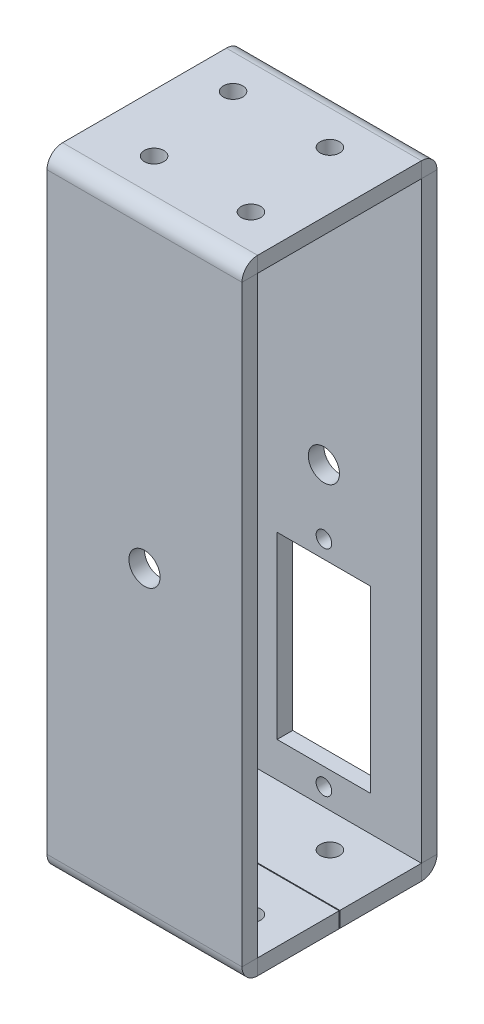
ISO-10303-21;
HEADER;
FILE_DESCRIPTION(('STEP AP214'),'2;1');
FILE_NAME('part.step','',(''),(''),'','','');
FILE_SCHEMA(('AUTOMOTIVE_DESIGN { 1 0 10303 214 1 1 1 1 }'));
ENDSEC;
DATA;
#1=APPLICATION_CONTEXT('core data for automotive mechanical design processes');
#2=APPLICATION_PROTOCOL_DEFINITION('international standard','automotive_design',2000,#1);
#3=PRODUCT_CONTEXT('',#1,'mechanical');
#4=PRODUCT('Part','Part','',(#3));
#5=PRODUCT_RELATED_PRODUCT_CATEGORY('part','',(#4));
#6=PRODUCT_DEFINITION_FORMATION('','',#4);
#7=PRODUCT_DEFINITION_CONTEXT('part definition',#1,'design');
#8=PRODUCT_DEFINITION('design','',#6,#7);
#9=PRODUCT_DEFINITION_SHAPE('','',#8);
#10=(LENGTH_UNIT() NAMED_UNIT(*) SI_UNIT(.MILLI.,.METRE.));
#11=(NAMED_UNIT(*) PLANE_ANGLE_UNIT() SI_UNIT($,.RADIAN.));
#12=(NAMED_UNIT(*) SI_UNIT($,.STERADIAN.) SOLID_ANGLE_UNIT());
#13=UNCERTAINTY_MEASURE_WITH_UNIT(LENGTH_MEASURE(1.E-05),#10,'distance_accuracy_value','');
#14=(GEOMETRIC_REPRESENTATION_CONTEXT(3) GLOBAL_UNCERTAINTY_ASSIGNED_CONTEXT((#13)) GLOBAL_UNIT_ASSIGNED_CONTEXT((#10,
#11,#12)) REPRESENTATION_CONTEXT('',''));
#15=CARTESIAN_POINT('',(0.,0.,0.));
#16=DIRECTION('',(0.,0.,1.));
#17=DIRECTION('',(1.,0.,0.));
#18=AXIS2_PLACEMENT_3D('',#15,#16,#17);
#19=CARTESIAN_POINT('',(0.,-40.,10.5));
#20=DIRECTION('',(1.,0.,0.));
#21=DIRECTION('',(0.,0.,-1.));
#22=AXIS2_PLACEMENT_3D('',#19,#20,#21);
#23=PLANE('',#22);
#24=DIRECTION('',(0.,-1.,0.));
#25=VECTOR('',#24,1.);
#26=CARTESIAN_POINT('',(0.,-38.,-0.0500000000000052));
#27=LINE('',#26,#25);
#28=CARTESIAN_POINT('',(0.,-38.,-0.0500000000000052));
#29=VERTEX_POINT('',#28);
#30=CARTESIAN_POINT('',(0.,-40.,-0.0500000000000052));
#31=VERTEX_POINT('',#30);
#32=EDGE_CURVE('E1094',#29,#31,#27,.T.);
#33=ORIENTED_EDGE('',*,*,#32,.F.);
#34=DIRECTION('',(0.,0.,1.));
#35=VECTOR('',#34,1.);
#36=CARTESIAN_POINT('',(0.,-38.,10.5));
#37=LINE('',#36,#35);
#38=CARTESIAN_POINT('',(0.,-38.,-10.5));
#39=VERTEX_POINT('',#38);
#40=EDGE_CURVE('E425',#29,#39,#37,.F.);
#41=ORIENTED_EDGE('',*,*,#40,.T.);
#42=DIRECTION('',(0.,-1.,0.));
#43=VECTOR('',#42,1.);
#44=CARTESIAN_POINT('',(0.,-38.,-10.5));
#45=LINE('',#44,#43);
#46=CARTESIAN_POINT('',(0.,-40.,-10.5));
#47=VERTEX_POINT('',#46);
#48=EDGE_CURVE('E269',#39,#47,#45,.T.);
#49=ORIENTED_EDGE('',*,*,#48,.T.);
#50=DIRECTION('',(0.,0.,-1.));
#51=VECTOR('',#50,1.);
#52=CARTESIAN_POINT('',(0.,-40.,10.5));
#53=LINE('',#52,#51);
#54=EDGE_CURVE('E384',#31,#47,#53,.T.);
#55=ORIENTED_EDGE('',*,*,#54,.F.);
#56=EDGE_LOOP('',(#33,#41,#49,#55));
#57=FACE_BOUND('',#56,.T.);
#58=ADVANCED_FACE('F53',(#57),#23,.F.);
#59=CARTESIAN_POINT('',(25.,-40.,10.5));
#60=DIRECTION('',(1.,0.,0.));
#61=DIRECTION('',(0.,0.,-1.));
#62=AXIS2_PLACEMENT_3D('',#59,#60,#61);
#63=PLANE('',#62);
#64=DIRECTION('',(0.,0.,-1.));
#65=VECTOR('',#64,1.);
#66=CARTESIAN_POINT('',(25.,-40.,10.5));
#67=LINE('',#66,#65);
#68=CARTESIAN_POINT('',(25.,-40.,10.5));
#69=VERTEX_POINT('',#68);
#70=CARTESIAN_POINT('',(25.,-40.,0.0499999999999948));
#71=VERTEX_POINT('',#70);
#72=EDGE_CURVE('E204',#69,#71,#67,.T.);
#73=ORIENTED_EDGE('',*,*,#72,.T.);
#74=DIRECTION('',(0.,1.,0.));
#75=VECTOR('',#74,1.);
#76=CARTESIAN_POINT('',(25.,-40.,0.0499999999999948));
#77=LINE('',#76,#75);
#78=CARTESIAN_POINT('',(25.,-38.,0.0499999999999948));
#79=VERTEX_POINT('',#78);
#80=EDGE_CURVE('E190',#71,#79,#77,.T.);
#81=ORIENTED_EDGE('',*,*,#80,.T.);
#82=DIRECTION('',(0.,0.,1.));
#83=VECTOR('',#82,1.);
#84=CARTESIAN_POINT('',(25.,-38.,10.5));
#85=LINE('',#84,#83);
#86=CARTESIAN_POINT('',(25.,-38.,10.5));
#87=VERTEX_POINT('',#86);
#88=EDGE_CURVE('E202',#87,#79,#85,.F.);
#89=ORIENTED_EDGE('',*,*,#88,.F.);
#90=DIRECTION('',(0.,-1.,0.));
#91=VECTOR('',#90,1.);
#92=CARTESIAN_POINT('',(25.,-38.,10.5));
#93=LINE('',#92,#91);
#94=EDGE_CURVE('E300',#87,#69,#93,.T.);
#95=ORIENTED_EDGE('',*,*,#94,.T.);
#96=EDGE_LOOP('',(#73,#81,#89,#95));
#97=FACE_BOUND('',#96,.T.);
#98=ADVANCED_FACE('F201',(#97),#63,.T.);
#99=CARTESIAN_POINT('',(25.,-38.,-0.0500000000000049));
#100=VERTEX_POINT('',#99);
#101=CARTESIAN_POINT('',(25.,-38.,-10.5));
#102=VERTEX_POINT('',#101);
#103=EDGE_CURVE('E211',#100,#102,#85,.F.);
#104=ORIENTED_EDGE('',*,*,#103,.F.);
#105=DIRECTION('',(0.,-1.,0.));
#106=VECTOR('',#105,1.);
#107=CARTESIAN_POINT('',(25.,-38.,-0.0500000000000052));
#108=LINE('',#107,#106);
#109=CARTESIAN_POINT('',(25.,-40.,-0.0500000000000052));
#110=VERTEX_POINT('',#109);
#111=EDGE_CURVE('E69',#100,#110,#108,.T.);
#112=ORIENTED_EDGE('',*,*,#111,.T.);
#113=CARTESIAN_POINT('',(25.,-40.,-10.5));
#114=VERTEX_POINT('',#113);
#115=EDGE_CURVE('E391',#110,#114,#67,.T.);
#116=ORIENTED_EDGE('',*,*,#115,.T.);
#117=DIRECTION('',(0.,-1.,0.));
#118=VECTOR('',#117,1.);
#119=CARTESIAN_POINT('',(25.,-38.,-10.5));
#120=LINE('',#119,#118);
#121=EDGE_CURVE('E285',#102,#114,#120,.T.);
#122=ORIENTED_EDGE('',*,*,#121,.F.);
#123=EDGE_LOOP('',(#104,#112,#116,#122));
#124=FACE_BOUND('',#123,.T.);
#125=ADVANCED_FACE('F508',(#124),#63,.T.);
#126=CARTESIAN_POINT('',(25.,-40.,10.5));
#127=DIRECTION('',(0.,1.,0.));
#128=DIRECTION('',(0.,0.,1.));
#129=AXIS2_PLACEMENT_3D('',#126,#127,#128);
#130=PLANE('',#129);
#131=CARTESIAN_POINT('',(5.233343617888,-40.,-6.11928958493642));
#132=DIRECTION('',(0.,1.,0.));
#133=DIRECTION('',(0.,0.,1.));
#134=AXIS2_PLACEMENT_3D('',#131,#132,#133);
#135=CIRCLE('',#134,1.25);
#136=CARTESIAN_POINT('',(5.233343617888,-40.,-4.86928958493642));
#137=VERTEX_POINT('',#136);
#138=EDGE_CURVE('E378',#137,#137,#135,.T.);
#139=ORIENTED_EDGE('',*,*,#138,.T.);
#140=EDGE_LOOP('',(#139));
#141=FACE_BOUND('',#140,.T.);
#142=CARTESIAN_POINT('',(17.6530859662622,-40.,-6.11928958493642));
#143=DIRECTION('',(0.,1.,0.));
#144=DIRECTION('',(0.,0.,1.));
#145=AXIS2_PLACEMENT_3D('',#142,#143,#144);
#146=CIRCLE('',#145,1.25);
#147=CARTESIAN_POINT('',(17.6530859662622,-40.,-4.86928958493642));
#148=VERTEX_POINT('',#147);
#149=EDGE_CURVE('E375',#148,#148,#146,.T.);
#150=ORIENTED_EDGE('',*,*,#149,.T.);
#151=EDGE_LOOP('',(#150));
#152=FACE_BOUND('',#151,.T.);
#153=DIRECTION('',(1.,0.,0.));
#154=VECTOR('',#153,1.);
#155=CARTESIAN_POINT('',(-16.5,-40.,-0.0500000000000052));
#156=LINE('',#155,#154);
#157=EDGE_CURVE('E1101',#31,#110,#156,.T.);
#158=ORIENTED_EDGE('',*,*,#157,.F.);
#159=ORIENTED_EDGE('',*,*,#54,.T.);
#160=DIRECTION('',(-1.,0.,0.));
#161=VECTOR('',#160,1.);
#162=CARTESIAN_POINT('',(25.,-40.,-10.5));
#163=LINE('',#162,#161);
#164=EDGE_CURVE('E388',#114,#47,#163,.T.);
#165=ORIENTED_EDGE('',*,*,#164,.F.);
#166=ORIENTED_EDGE('',*,*,#115,.F.);
#167=EDGE_LOOP('',(#158,#159,#165,#166));
#168=FACE_BOUND('',#167,.T.);
#169=ADVANCED_FACE('F1028',(#141,#152,#168),#130,.F.);
#170=CARTESIAN_POINT('',(19.766656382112,-40.,6.11928958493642));
#171=DIRECTION('',(0.,1.,0.));
#172=DIRECTION('',(0.,0.,1.));
#173=AXIS2_PLACEMENT_3D('',#170,#171,#172);
#174=CIRCLE('',#173,1.25);
#175=CARTESIAN_POINT('',(19.766656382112,-40.,7.36928958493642));
#176=VERTEX_POINT('',#175);
#177=EDGE_CURVE('E381',#176,#176,#174,.T.);
#178=ORIENTED_EDGE('',*,*,#177,.T.);
#179=EDGE_LOOP('',(#178));
#180=FACE_BOUND('',#179,.T.);
#181=CARTESIAN_POINT('',(7.34691403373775,-40.,6.11928958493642));
#182=DIRECTION('',(0.,1.,0.));
#183=DIRECTION('',(0.,0.,1.));
#184=AXIS2_PLACEMENT_3D('',#181,#182,#183);
#185=CIRCLE('',#184,1.25);
#186=CARTESIAN_POINT('',(7.34691403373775,-40.,7.36928958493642));
#187=VERTEX_POINT('',#186);
#188=EDGE_CURVE('E372',#187,#187,#185,.T.);
#189=ORIENTED_EDGE('',*,*,#188,.T.);
#190=EDGE_LOOP('',(#189));
#191=FACE_BOUND('',#190,.T.);
#192=DIRECTION('',(1.,0.,0.));
#193=VECTOR('',#192,1.);
#194=CARTESIAN_POINT('',(-16.5,-40.,0.0499999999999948));
#195=LINE('',#194,#193);
#196=CARTESIAN_POINT('',(0.,-40.,0.0499999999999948));
#197=VERTEX_POINT('',#196);
#198=EDGE_CURVE('E196',#197,#71,#195,.T.);
#199=ORIENTED_EDGE('',*,*,#198,.T.);
#200=ORIENTED_EDGE('',*,*,#72,.F.);
#201=DIRECTION('',(-1.,0.,0.));
#202=VECTOR('',#201,1.);
#203=CARTESIAN_POINT('',(25.,-40.,10.5));
#204=LINE('',#203,#202);
#205=CARTESIAN_POINT('',(0.,-40.,10.5));
#206=VERTEX_POINT('',#205);
#207=EDGE_CURVE('E393',#69,#206,#204,.T.);
#208=ORIENTED_EDGE('',*,*,#207,.T.);
#209=EDGE_CURVE('E385',#206,#197,#53,.T.);
#210=ORIENTED_EDGE('',*,*,#209,.T.);
#211=EDGE_LOOP('',(#199,#200,#208,#210));
#212=FACE_BOUND('',#211,.T.);
#213=ADVANCED_FACE('F1039',(#180,#191,#212),#130,.F.);
#214=CARTESIAN_POINT('',(25.,-38.,10.5));
#215=DIRECTION('',(0.,1.,0.));
#216=DIRECTION('',(0.,0.,1.));
#217=AXIS2_PLACEMENT_3D('',#214,#215,#216);
#218=PLANE('',#217);
#219=CARTESIAN_POINT('',(17.6530859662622,-38.,-6.11928958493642));
#220=DIRECTION('',(0.,1.,0.));
#221=DIRECTION('',(0.,0.,1.));
#222=AXIS2_PLACEMENT_3D('',#219,#220,#221);
#223=CIRCLE('',#222,1.25);
#224=CARTESIAN_POINT('',(17.6530859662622,-38.,-4.86928958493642));
#225=VERTEX_POINT('',#224);
#226=EDGE_CURVE('E416',#225,#225,#223,.T.);
#227=ORIENTED_EDGE('',*,*,#226,.F.);
#228=EDGE_LOOP('',(#227));
#229=FACE_BOUND('',#228,.T.);
#230=CARTESIAN_POINT('',(5.233343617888,-38.,-6.11928958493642));
#231=DIRECTION('',(0.,1.,0.));
#232=DIRECTION('',(0.,0.,1.));
#233=AXIS2_PLACEMENT_3D('',#230,#231,#232);
#234=CIRCLE('',#233,1.25);
#235=CARTESIAN_POINT('',(5.233343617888,-38.,-4.86928958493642));
#236=VERTEX_POINT('',#235);
#237=EDGE_CURVE('E419',#236,#236,#234,.T.);
#238=ORIENTED_EDGE('',*,*,#237,.F.);
#239=EDGE_LOOP('',(#238));
#240=FACE_BOUND('',#239,.T.);
#241=ORIENTED_EDGE('',*,*,#40,.F.);
#242=DIRECTION('',(1.,0.,0.));
#243=VECTOR('',#242,1.);
#244=CARTESIAN_POINT('',(-16.5,-38.,-0.0500000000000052));
#245=LINE('',#244,#243);
#246=EDGE_CURVE('E1089',#29,#100,#245,.T.);
#247=ORIENTED_EDGE('',*,*,#246,.T.);
#248=ORIENTED_EDGE('',*,*,#103,.T.);
#249=DIRECTION('',(-1.,0.,0.));
#250=VECTOR('',#249,1.);
#251=CARTESIAN_POINT('',(25.,-38.,-10.5));
#252=LINE('',#251,#250);
#253=EDGE_CURVE('E223',#102,#39,#252,.T.);
#254=ORIENTED_EDGE('',*,*,#253,.T.);
#255=EDGE_LOOP('',(#241,#247,#248,#254));
#256=FACE_BOUND('',#255,.T.);
#257=ADVANCED_FACE('F1050',(#229,#240,#256),#218,.T.);
#258=CARTESIAN_POINT('',(19.766656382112,-38.,6.11928958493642));
#259=DIRECTION('',(0.,1.,0.));
#260=DIRECTION('',(0.,0.,1.));
#261=AXIS2_PLACEMENT_3D('',#258,#259,#260);
#262=CIRCLE('',#261,1.25);
#263=CARTESIAN_POINT('',(19.766656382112,-38.,7.36928958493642));
#264=VERTEX_POINT('',#263);
#265=EDGE_CURVE('E422',#264,#264,#262,.T.);
#266=ORIENTED_EDGE('',*,*,#265,.F.);
#267=EDGE_LOOP('',(#266));
#268=FACE_BOUND('',#267,.T.);
#269=CARTESIAN_POINT('',(7.34691403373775,-38.,6.11928958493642));
#270=DIRECTION('',(0.,1.,0.));
#271=DIRECTION('',(0.,0.,1.));
#272=AXIS2_PLACEMENT_3D('',#269,#270,#271);
#273=CIRCLE('',#272,1.25);
#274=CARTESIAN_POINT('',(7.34691403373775,-38.,7.36928958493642));
#275=VERTEX_POINT('',#274);
#276=EDGE_CURVE('E411',#275,#275,#273,.T.);
#277=ORIENTED_EDGE('',*,*,#276,.F.);
#278=EDGE_LOOP('',(#277));
#279=FACE_BOUND('',#278,.T.);
#280=ORIENTED_EDGE('',*,*,#88,.T.);
#281=DIRECTION('',(1.,0.,0.));
#282=VECTOR('',#281,1.);
#283=CARTESIAN_POINT('',(-16.5,-38.,0.0499999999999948));
#284=LINE('',#283,#282);
#285=CARTESIAN_POINT('',(0.,-38.,0.0499999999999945));
#286=VERTEX_POINT('',#285);
#287=EDGE_CURVE('E187',#286,#79,#284,.T.);
#288=ORIENTED_EDGE('',*,*,#287,.F.);
#289=CARTESIAN_POINT('',(0.,-38.,10.5));
#290=VERTEX_POINT('',#289);
#291=EDGE_CURVE('E215',#290,#286,#37,.F.);
#292=ORIENTED_EDGE('',*,*,#291,.F.);
#293=DIRECTION('',(-1.,0.,0.));
#294=VECTOR('',#293,1.);
#295=CARTESIAN_POINT('',(25.,-38.,10.5));
#296=LINE('',#295,#294);
#297=EDGE_CURVE('E209',#87,#290,#296,.T.);
#298=ORIENTED_EDGE('',*,*,#297,.F.);
#299=EDGE_LOOP('',(#280,#288,#292,#298));
#300=FACE_BOUND('',#299,.T.);
#301=ADVANCED_FACE('F207',(#268,#279,#300),#218,.T.);
#302=CARTESIAN_POINT('',(18.5,-10.5,-12.5));
#303=DIRECTION('',(0.,-1.,0.));
#304=DIRECTION('',(1.,0.,0.));
#305=AXIS2_PLACEMENT_3D('',#302,#303,#304);
#306=PLANE('',#305);
#307=DIRECTION('',(0.,0.,-1.));
#308=VECTOR('',#307,1.);
#309=CARTESIAN_POINT('',(18.5,-10.5,-12.5));
#310=LINE('',#309,#308);
#311=CARTESIAN_POINT('',(18.5,-10.5,-10.5));
#312=VERTEX_POINT('',#311);
#313=CARTESIAN_POINT('',(18.5,-10.5,-12.5));
#314=VERTEX_POINT('',#313);
#315=EDGE_CURVE('E13',#312,#314,#310,.T.);
#316=ORIENTED_EDGE('',*,*,#315,.F.);
#317=DIRECTION('',(1.,0.,0.));
#318=VECTOR('',#317,1.);
#319=CARTESIAN_POINT('',(25.,-10.5,-10.5));
#320=LINE('',#319,#318);
#321=CARTESIAN_POINT('',(6.50000000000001,-10.5,-10.5));
#322=VERTEX_POINT('',#321);
#323=EDGE_CURVE('E262',#322,#312,#320,.T.);
#324=ORIENTED_EDGE('',*,*,#323,.F.);
#325=DIRECTION('',(0.,0.,-1.));
#326=VECTOR('',#325,1.);
#327=CARTESIAN_POINT('',(6.50000000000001,-10.5,-12.5));
#328=LINE('',#327,#326);
#329=CARTESIAN_POINT('',(6.50000000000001,-10.5,-12.5));
#330=VERTEX_POINT('',#329);
#331=EDGE_CURVE('E62',#322,#330,#328,.T.);
#332=ORIENTED_EDGE('',*,*,#331,.T.);
#333=DIRECTION('',(1.,0.,0.));
#334=VECTOR('',#333,1.);
#335=CARTESIAN_POINT('',(18.5,-10.5,-12.5));
#336=LINE('',#335,#334);
#337=EDGE_CURVE('E311',#330,#314,#336,.T.);
#338=ORIENTED_EDGE('',*,*,#337,.T.);
#339=EDGE_LOOP('',(#316,#324,#332,#338));
#340=FACE_BOUND('',#339,.T.);
#341=ADVANCED_FACE('F310',(#340),#306,.T.);
#342=CARTESIAN_POINT('',(6.50000000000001,-33.5,-12.5));
#343=DIRECTION('',(1.,0.,0.));
#344=DIRECTION('',(0.,1.,0.));
#345=AXIS2_PLACEMENT_3D('',#342,#343,#344);
#346=PLANE('',#345);
#347=ORIENTED_EDGE('',*,*,#331,.F.);
#348=DIRECTION('',(0.,1.,0.));
#349=VECTOR('',#348,1.);
#350=CARTESIAN_POINT('',(6.50000000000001,38.,-10.5));
#351=LINE('',#350,#349);
#352=CARTESIAN_POINT('',(6.50000000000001,-33.5,-10.5));
#353=VERTEX_POINT('',#352);
#354=EDGE_CURVE('E258',#353,#322,#351,.T.);
#355=ORIENTED_EDGE('',*,*,#354,.F.);
#356=DIRECTION('',(0.,0.,-1.));
#357=VECTOR('',#356,1.);
#358=CARTESIAN_POINT('',(6.50000000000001,-33.5,-12.5));
#359=LINE('',#358,#357);
#360=CARTESIAN_POINT('',(6.50000000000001,-33.5,-12.5));
#361=VERTEX_POINT('',#360);
#362=EDGE_CURVE('E304',#353,#361,#359,.T.);
#363=ORIENTED_EDGE('',*,*,#362,.T.);
#364=DIRECTION('',(0.,1.,0.));
#365=VECTOR('',#364,1.);
#366=CARTESIAN_POINT('',(6.50000000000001,-33.5,-12.5));
#367=LINE('',#366,#365);
#368=EDGE_CURVE('E321',#361,#330,#367,.T.);
#369=ORIENTED_EDGE('',*,*,#368,.T.);
#370=EDGE_LOOP('',(#347,#355,#363,#369));
#371=FACE_BOUND('',#370,.T.);
#372=ADVANCED_FACE('F325',(#371),#346,.T.);
#373=CARTESIAN_POINT('',(18.5,-33.5,-12.5));
#374=DIRECTION('',(0.,1.,0.));
#375=DIRECTION('',(-1.,0.,0.));
#376=AXIS2_PLACEMENT_3D('',#373,#374,#375);
#377=PLANE('',#376);
#378=ORIENTED_EDGE('',*,*,#362,.F.);
#379=DIRECTION('',(1.,0.,0.));
#380=VECTOR('',#379,1.);
#381=CARTESIAN_POINT('',(25.,-33.5,-10.5));
#382=LINE('',#381,#380);
#383=CARTESIAN_POINT('',(18.5,-33.5,-10.5));
#384=VERTEX_POINT('',#383);
#385=EDGE_CURVE('E254',#384,#353,#382,.F.);
#386=ORIENTED_EDGE('',*,*,#385,.F.);
#387=DIRECTION('',(0.,0.,-1.));
#388=VECTOR('',#387,1.);
#389=CARTESIAN_POINT('',(18.5,-33.5,-12.5));
#390=LINE('',#389,#388);
#391=CARTESIAN_POINT('',(18.5,-33.5,-12.5));
#392=VERTEX_POINT('',#391);
#393=EDGE_CURVE('E57',#384,#392,#390,.T.);
#394=ORIENTED_EDGE('',*,*,#393,.T.);
#395=DIRECTION('',(-1.,0.,0.));
#396=VECTOR('',#395,1.);
#397=CARTESIAN_POINT('',(18.5,-33.5,-12.5));
#398=LINE('',#397,#396);
#399=EDGE_CURVE('E1132',#392,#361,#398,.T.);
#400=ORIENTED_EDGE('',*,*,#399,.T.);
#401=EDGE_LOOP('',(#378,#386,#394,#400));
#402=FACE_BOUND('',#401,.T.);
#403=ADVANCED_FACE('F622',(#402),#377,.T.);
#404=CARTESIAN_POINT('',(25.,-38.,10.5));
#405=DIRECTION('',(-1.,0.,0.));
#406=DIRECTION('',(0.,0.,1.));
#407=AXIS2_PLACEMENT_3D('',#404,#405,#406);
#408=PLANE('',#407);
#409=ORIENTED_EDGE('',*,*,#94,.F.);
#410=DIRECTION('',(0.,0.,1.));
#411=VECTOR('',#410,1.);
#412=CARTESIAN_POINT('',(25.,-38.,10.5));
#413=LINE('',#412,#411);
#414=CARTESIAN_POINT('',(25.,-38.,12.5));
#415=VERTEX_POINT('',#414);
#416=EDGE_CURVE('E298',#87,#415,#413,.T.);
#417=ORIENTED_EDGE('',*,*,#416,.T.);
#418=CARTESIAN_POINT('',(25.,-38.,10.5));
#419=DIRECTION('',(1.,0.,0.));
#420=DIRECTION('',(0.,0.,-1.));
#421=AXIS2_PLACEMENT_3D('',#418,#419,#420);
#422=CIRCLE('',#421,1.99999999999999);
#423=EDGE_CURVE('E399',#415,#69,#422,.T.);
#424=ORIENTED_EDGE('',*,*,#423,.T.);
#425=EDGE_LOOP('',(#409,#417,#424));
#426=FACE_BOUND('',#425,.T.);
#427=ADVANCED_FACE('F612',(#426),#408,.F.);
#428=CARTESIAN_POINT('',(25.,38.,12.5));
#429=DIRECTION('',(1.,0.,0.));
#430=DIRECTION('',(0.,-1.,0.));
#431=AXIS2_PLACEMENT_3D('',#428,#429,#430);
#432=PLANE('',#431);
#433=ORIENTED_EDGE('',*,*,#416,.F.);
#434=DIRECTION('',(0.,1.,0.));
#435=VECTOR('',#434,1.);
#436=CARTESIAN_POINT('',(25.,38.,10.5));
#437=LINE('',#436,#435);
#438=CARTESIAN_POINT('',(25.,38.,10.5));
#439=VERTEX_POINT('',#438);
#440=EDGE_CURVE('E229',#439,#87,#437,.F.);
#441=ORIENTED_EDGE('',*,*,#440,.F.);
#442=DIRECTION('',(0.,0.,1.));
#443=VECTOR('',#442,1.);
#444=CARTESIAN_POINT('',(25.,38.,10.5));
#445=LINE('',#444,#443);
#446=CARTESIAN_POINT('',(25.,38.,12.5));
#447=VERTEX_POINT('',#446);
#448=EDGE_CURVE('E296',#439,#447,#445,.T.);
#449=ORIENTED_EDGE('',*,*,#448,.T.);
#450=DIRECTION('',(0.,-1.,0.));
#451=VECTOR('',#450,1.);
#452=CARTESIAN_POINT('',(25.,38.,12.5));
#453=LINE('',#452,#451);
#454=EDGE_CURVE('E360',#447,#415,#453,.T.);
#455=ORIENTED_EDGE('',*,*,#454,.T.);
#456=EDGE_LOOP('',(#433,#441,#449,#455));
#457=FACE_BOUND('',#456,.T.);
#458=ADVANCED_FACE('F461',(#457),#432,.T.);
#459=CARTESIAN_POINT('',(25.,38.,10.5));
#460=DIRECTION('',(-1.,0.,0.));
#461=DIRECTION('',(0.,0.,1.));
#462=AXIS2_PLACEMENT_3D('',#459,#460,#461);
#463=PLANE('',#462);
#464=ORIENTED_EDGE('',*,*,#448,.F.);
#465=DIRECTION('',(0.,1.,0.));
#466=VECTOR('',#465,1.);
#467=CARTESIAN_POINT('',(25.,38.,10.5));
#468=LINE('',#467,#466);
#469=CARTESIAN_POINT('',(25.,40.,10.5));
#470=VERTEX_POINT('',#469);
#471=EDGE_CURVE('E294',#439,#470,#468,.T.);
#472=ORIENTED_EDGE('',*,*,#471,.T.);
#473=CARTESIAN_POINT('',(25.,38.,10.5));
#474=DIRECTION('',(1.,0.,0.));
#475=DIRECTION('',(0.,0.,-1.));
#476=AXIS2_PLACEMENT_3D('',#473,#474,#475);
#477=CIRCLE('',#476,1.99999999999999);
#478=EDGE_CURVE('E369',#470,#447,#477,.T.);
#479=ORIENTED_EDGE('',*,*,#478,.T.);
#480=EDGE_LOOP('',(#464,#472,#479));
#481=FACE_BOUND('',#480,.T.);
#482=ADVANCED_FACE('F592',(#481),#463,.F.);
#483=CARTESIAN_POINT('',(25.,40.,10.5));
#484=DIRECTION('',(1.,0.,0.));
#485=DIRECTION('',(0.,0.,1.));
#486=AXIS2_PLACEMENT_3D('',#483,#484,#485);
#487=PLANE('',#486);
#488=ORIENTED_EDGE('',*,*,#471,.F.);
#489=DIRECTION('',(0.,0.,-1.));
#490=VECTOR('',#489,1.);
#491=CARTESIAN_POINT('',(25.,38.,10.5));
#492=LINE('',#491,#490);
#493=CARTESIAN_POINT('',(25.,38.,-10.5));
#494=VERTEX_POINT('',#493);
#495=EDGE_CURVE('E224',#494,#439,#492,.F.);
#496=ORIENTED_EDGE('',*,*,#495,.F.);
#497=DIRECTION('',(0.,1.,0.));
#498=VECTOR('',#497,1.);
#499=CARTESIAN_POINT('',(25.,38.,-10.5));
#500=LINE('',#499,#498);
#501=CARTESIAN_POINT('',(25.,40.,-10.5));
#502=VERTEX_POINT('',#501);
#503=EDGE_CURVE('E292',#494,#502,#500,.T.);
#504=ORIENTED_EDGE('',*,*,#503,.T.);
#505=DIRECTION('',(0.,0.,1.));
#506=VECTOR('',#505,1.);
#507=CARTESIAN_POINT('',(25.,40.,10.5));
#508=LINE('',#507,#506);
#509=EDGE_CURVE('E1121',#502,#470,#508,.T.);
#510=ORIENTED_EDGE('',*,*,#509,.T.);
#511=EDGE_LOOP('',(#488,#496,#504,#510));
#512=FACE_BOUND('',#511,.T.);
#513=ADVANCED_FACE('F455',(#512),#487,.T.);
#514=CARTESIAN_POINT('',(25.,38.,-10.5));
#515=DIRECTION('',(-1.,0.,0.));
#516=DIRECTION('',(0.,0.,1.));
#517=AXIS2_PLACEMENT_3D('',#514,#515,#516);
#518=PLANE('',#517);
#519=ORIENTED_EDGE('',*,*,#503,.F.);
#520=DIRECTION('',(0.,0.,-1.));
#521=VECTOR('',#520,1.);
#522=CARTESIAN_POINT('',(25.,38.,-10.5));
#523=LINE('',#522,#521);
#524=CARTESIAN_POINT('',(25.,38.,-12.5));
#525=VERTEX_POINT('',#524);
#526=EDGE_CURVE('E290',#494,#525,#523,.T.);
#527=ORIENTED_EDGE('',*,*,#526,.T.);
#528=CARTESIAN_POINT('',(25.,38.,-10.5));
#529=DIRECTION('',(1.,0.,0.));
#530=DIRECTION('',(0.,0.,1.));
#531=AXIS2_PLACEMENT_3D('',#528,#529,#530);
#532=CIRCLE('',#531,2.);
#533=EDGE_CURVE('E348',#525,#502,#532,.T.);
#534=ORIENTED_EDGE('',*,*,#533,.T.);
#535=EDGE_LOOP('',(#519,#527,#534));
#536=FACE_BOUND('',#535,.T.);
#537=ADVANCED_FACE('F572',(#536),#518,.F.);
#538=CARTESIAN_POINT('',(25.,38.,-12.5));
#539=DIRECTION('',(1.,0.,0.));
#540=DIRECTION('',(0.,1.,0.));
#541=AXIS2_PLACEMENT_3D('',#538,#539,#540);
#542=PLANE('',#541);
#543=ORIENTED_EDGE('',*,*,#526,.F.);
#544=DIRECTION('',(0.,1.,0.));
#545=VECTOR('',#544,1.);
#546=CARTESIAN_POINT('',(25.,38.,-10.5));
#547=LINE('',#546,#545);
#548=EDGE_CURVE('E220',#102,#494,#547,.T.);
#549=ORIENTED_EDGE('',*,*,#548,.F.);
#550=DIRECTION('',(0.,0.,-1.));
#551=VECTOR('',#550,1.);
#552=CARTESIAN_POINT('',(25.,-38.,-10.5));
#553=LINE('',#552,#551);
#554=CARTESIAN_POINT('',(25.,-38.,-12.5));
#555=VERTEX_POINT('',#554);
#556=EDGE_CURVE('E288',#102,#555,#553,.T.);
#557=ORIENTED_EDGE('',*,*,#556,.T.);
#558=DIRECTION('',(0.,1.,0.));
#559=VECTOR('',#558,1.);
#560=CARTESIAN_POINT('',(25.,38.,-12.5));
#561=LINE('',#560,#559);
#562=EDGE_CURVE('E339',#555,#525,#561,.T.);
#563=ORIENTED_EDGE('',*,*,#562,.T.);
#564=EDGE_LOOP('',(#543,#549,#557,#563));
#565=FACE_BOUND('',#564,.T.);
#566=ADVANCED_FACE('F561',(#565),#542,.T.);
#567=CARTESIAN_POINT('',(25.,-38.,-10.5));
#568=DIRECTION('',(-1.,0.,0.));
#569=DIRECTION('',(0.,0.,1.));
#570=AXIS2_PLACEMENT_3D('',#567,#568,#569);
#571=PLANE('',#570);
#572=ORIENTED_EDGE('',*,*,#556,.F.);
#573=ORIENTED_EDGE('',*,*,#121,.T.);
#574=CARTESIAN_POINT('',(25.,-38.,-10.5));
#575=DIRECTION('',(1.,0.,0.));
#576=DIRECTION('',(0.,0.,-1.));
#577=AXIS2_PLACEMENT_3D('',#574,#575,#576);
#578=CIRCLE('',#577,1.99999999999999);
#579=EDGE_CURVE('E287',#114,#555,#578,.T.);
#580=ORIENTED_EDGE('',*,*,#579,.T.);
#581=EDGE_LOOP('',(#572,#573,#580));
#582=FACE_BOUND('',#581,.T.);
#583=ADVANCED_FACE('F550',(#582),#571,.F.);
#584=CARTESIAN_POINT('',(0.,38.,-10.5));
#585=DIRECTION('',(-1.,0.,0.));
#586=DIRECTION('',(0.,0.,1.));
#587=AXIS2_PLACEMENT_3D('',#584,#585,#586);
#588=PLANE('',#587);
#589=DIRECTION('',(0.,0.,-1.));
#590=VECTOR('',#589,1.);
#591=CARTESIAN_POINT('',(0.,38.,-10.5));
#592=LINE('',#591,#590);
#593=CARTESIAN_POINT('',(0.,38.,-10.5));
#594=VERTEX_POINT('',#593);
#595=CARTESIAN_POINT('',(0.,38.,-12.5));
#596=VERTEX_POINT('',#595);
#597=EDGE_CURVE('E283',#594,#596,#592,.T.);
#598=ORIENTED_EDGE('',*,*,#597,.F.);
#599=DIRECTION('',(0.,1.,0.));
#600=VECTOR('',#599,1.);
#601=CARTESIAN_POINT('',(0.,38.,-10.5));
#602=LINE('',#601,#600);
#603=CARTESIAN_POINT('',(0.,40.,-10.5));
#604=VERTEX_POINT('',#603);
#605=EDGE_CURVE('E281',#594,#604,#602,.T.);
#606=ORIENTED_EDGE('',*,*,#605,.T.);
#607=CARTESIAN_POINT('',(0.,38.,-10.5));
#608=DIRECTION('',(1.,0.,0.));
#609=DIRECTION('',(0.,0.,1.));
#610=AXIS2_PLACEMENT_3D('',#607,#608,#609);
#611=CIRCLE('',#610,2.);
#612=EDGE_CURVE('E345',#596,#604,#611,.T.);
#613=ORIENTED_EDGE('',*,*,#612,.F.);
#614=EDGE_LOOP('',(#598,#606,#613));
#615=FACE_BOUND('',#614,.T.);
#616=ADVANCED_FACE('F500',(#615),#588,.T.);
#617=CARTESIAN_POINT('',(0.,40.,10.5));
#618=DIRECTION('',(1.,0.,0.));
#619=DIRECTION('',(0.,0.,1.));
#620=AXIS2_PLACEMENT_3D('',#617,#618,#619);
#621=PLANE('',#620);
#622=ORIENTED_EDGE('',*,*,#605,.F.);
#623=DIRECTION('',(0.,0.,-1.));
#624=VECTOR('',#623,1.);
#625=CARTESIAN_POINT('',(0.,38.,10.5));
#626=LINE('',#625,#624);
#627=CARTESIAN_POINT('',(0.,38.,10.5));
#628=VERTEX_POINT('',#627);
#629=EDGE_CURVE('E228',#594,#628,#626,.F.);
#630=ORIENTED_EDGE('',*,*,#629,.T.);
#631=DIRECTION('',(0.,1.,0.));
#632=VECTOR('',#631,1.);
#633=CARTESIAN_POINT('',(0.,38.,10.5));
#634=LINE('',#633,#632);
#635=CARTESIAN_POINT('',(0.,40.,10.5));
#636=VERTEX_POINT('',#635);
#637=EDGE_CURVE('E279',#628,#636,#634,.T.);
#638=ORIENTED_EDGE('',*,*,#637,.T.);
#639=DIRECTION('',(0.,0.,1.));
#640=VECTOR('',#639,1.);
#641=CARTESIAN_POINT('',(0.,40.,10.5));
#642=LINE('',#641,#640);
#643=EDGE_CURVE('E1118',#604,#636,#642,.T.);
#644=ORIENTED_EDGE('',*,*,#643,.F.);
#645=EDGE_LOOP('',(#622,#630,#638,#644));
#646=FACE_BOUND('',#645,.T.);
#647=ADVANCED_FACE('F432',(#646),#621,.F.);
#648=CARTESIAN_POINT('',(0.,38.,10.5));
#649=DIRECTION('',(-1.,0.,0.));
#650=DIRECTION('',(0.,0.,1.));
#651=AXIS2_PLACEMENT_3D('',#648,#649,#650);
#652=PLANE('',#651);
#653=ORIENTED_EDGE('',*,*,#637,.F.);
#654=DIRECTION('',(0.,0.,1.));
#655=VECTOR('',#654,1.);
#656=CARTESIAN_POINT('',(0.,38.,10.5));
#657=LINE('',#656,#655);
#658=CARTESIAN_POINT('',(0.,38.,12.5));
#659=VERTEX_POINT('',#658);
#660=EDGE_CURVE('E277',#628,#659,#657,.T.);
#661=ORIENTED_EDGE('',*,*,#660,.T.);
#662=CARTESIAN_POINT('',(0.,38.,10.5));
#663=DIRECTION('',(1.,0.,0.));
#664=DIRECTION('',(0.,0.,-1.));
#665=AXIS2_PLACEMENT_3D('',#662,#663,#664);
#666=CIRCLE('',#665,1.99999999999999);
#667=EDGE_CURVE('E366',#636,#659,#666,.T.);
#668=ORIENTED_EDGE('',*,*,#667,.F.);
#669=EDGE_LOOP('',(#653,#661,#668));
#670=FACE_BOUND('',#669,.T.);
#671=ADVANCED_FACE('F492',(#670),#652,.T.);
#672=CARTESIAN_POINT('',(0.,38.,12.5));
#673=DIRECTION('',(1.,0.,0.));
#674=DIRECTION('',(0.,-1.,0.));
#675=AXIS2_PLACEMENT_3D('',#672,#673,#674);
#676=PLANE('',#675);
#677=ORIENTED_EDGE('',*,*,#660,.F.);
#678=DIRECTION('',(0.,1.,0.));
#679=VECTOR('',#678,1.);
#680=CARTESIAN_POINT('',(0.,38.,10.5));
#681=LINE('',#680,#679);
#682=EDGE_CURVE('E232',#628,#290,#681,.F.);
#683=ORIENTED_EDGE('',*,*,#682,.T.);
#684=DIRECTION('',(0.,0.,1.));
#685=VECTOR('',#684,1.);
#686=CARTESIAN_POINT('',(0.,-38.,10.5));
#687=LINE('',#686,#685);
#688=CARTESIAN_POINT('',(0.,-38.,12.5));
#689=VERTEX_POINT('',#688);
#690=EDGE_CURVE('E275',#290,#689,#687,.T.);
#691=ORIENTED_EDGE('',*,*,#690,.T.);
#692=DIRECTION('',(0.,-1.,0.));
#693=VECTOR('',#692,1.);
#694=CARTESIAN_POINT('',(0.,38.,12.5));
#695=LINE('',#694,#693);
#696=EDGE_CURVE('E354',#659,#689,#695,.T.);
#697=ORIENTED_EDGE('',*,*,#696,.F.);
#698=EDGE_LOOP('',(#677,#683,#691,#697));
#699=FACE_BOUND('',#698,.T.);
#700=ADVANCED_FACE('F467',(#699),#676,.F.);
#701=CARTESIAN_POINT('',(0.,-38.,10.5));
#702=DIRECTION('',(-1.,0.,0.));
#703=DIRECTION('',(0.,0.,1.));
#704=AXIS2_PLACEMENT_3D('',#701,#702,#703);
#705=PLANE('',#704);
#706=ORIENTED_EDGE('',*,*,#690,.F.);
#707=DIRECTION('',(0.,-1.,0.));
#708=VECTOR('',#707,1.);
#709=CARTESIAN_POINT('',(0.,-38.,10.5));
#710=LINE('',#709,#708);
#711=EDGE_CURVE('E272',#290,#206,#710,.T.);
#712=ORIENTED_EDGE('',*,*,#711,.T.);
#713=CARTESIAN_POINT('',(0.,-38.,10.5));
#714=DIRECTION('',(1.,0.,0.));
#715=DIRECTION('',(0.,0.,-1.));
#716=AXIS2_PLACEMENT_3D('',#713,#714,#715);
#717=CIRCLE('',#716,1.99999999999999);
#718=EDGE_CURVE('E396',#689,#206,#717,.T.);
#719=ORIENTED_EDGE('',*,*,#718,.F.);
#720=EDGE_LOOP('',(#706,#712,#719));
#721=FACE_BOUND('',#720,.T.);
#722=ADVANCED_FACE('F475',(#721),#705,.T.);
#723=DIRECTION('',(0.,1.,0.));
#724=VECTOR('',#723,1.);
#725=CARTESIAN_POINT('',(0.,-40.,0.0499999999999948));
#726=LINE('',#725,#724);
#727=EDGE_CURVE('E77',#197,#286,#726,.T.);
#728=ORIENTED_EDGE('',*,*,#727,.F.);
#729=ORIENTED_EDGE('',*,*,#209,.F.);
#730=ORIENTED_EDGE('',*,*,#711,.F.);
#731=ORIENTED_EDGE('',*,*,#291,.T.);
#732=EDGE_LOOP('',(#728,#729,#730,#731));
#733=FACE_BOUND('',#732,.T.);
#734=ADVANCED_FACE('F471',(#733),#23,.F.);
#735=CARTESIAN_POINT('',(0.,-38.,-10.5));
#736=DIRECTION('',(-1.,0.,0.));
#737=DIRECTION('',(0.,0.,1.));
#738=AXIS2_PLACEMENT_3D('',#735,#736,#737);
#739=PLANE('',#738);
#740=ORIENTED_EDGE('',*,*,#48,.F.);
#741=DIRECTION('',(0.,0.,-1.));
#742=VECTOR('',#741,1.);
#743=CARTESIAN_POINT('',(0.,-38.,-10.5));
#744=LINE('',#743,#742);
#745=CARTESIAN_POINT('',(0.,-38.,-12.5));
#746=VERTEX_POINT('',#745);
#747=EDGE_CURVE('E273',#39,#746,#744,.T.);
#748=ORIENTED_EDGE('',*,*,#747,.T.);
#749=CARTESIAN_POINT('',(0.,-38.,-10.5));
#750=DIRECTION('',(1.,0.,0.));
#751=DIRECTION('',(0.,0.,-1.));
#752=AXIS2_PLACEMENT_3D('',#749,#750,#751);
#753=CIRCLE('',#752,1.99999999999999);
#754=EDGE_CURVE('E402',#47,#746,#753,.T.);
#755=ORIENTED_EDGE('',*,*,#754,.F.);
#756=EDGE_LOOP('',(#740,#748,#755));
#757=FACE_BOUND('',#756,.T.);
#758=ADVANCED_FACE('F514',(#757),#739,.T.);
#759=CARTESIAN_POINT('',(7.34691403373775,40.,6.11928958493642));
#760=DIRECTION('',(0.,-1.,0.));
#761=DIRECTION('',(0.,0.,-1.));
#762=AXIS2_PLACEMENT_3D('',#759,#760,#761);
#763=CYLINDRICAL_SURFACE('',#762,1.25);
#764=CARTESIAN_POINT('',(7.34691403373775,40.,6.11928958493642));
#765=DIRECTION('',(0.,1.,0.));
#766=DIRECTION('',(0.,0.,1.));
#767=AXIS2_PLACEMENT_3D('',#764,#765,#766);
#768=CIRCLE('',#767,1.25);
#769=CARTESIAN_POINT('',(7.34691403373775,40.,4.86928958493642));
#770=VERTEX_POINT('',#769);
#771=EDGE_CURVE('E213',#770,#770,#768,.T.);
#772=CARTESIAN_POINT('',(7.34691403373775,38.,6.11928958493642));
#773=DIRECTION('',(0.,1.,0.));
#774=DIRECTION('',(0.,0.,1.));
#775=AXIS2_PLACEMENT_3D('',#772,#773,#774);
#776=CIRCLE('',#775,1.25);
#777=CARTESIAN_POINT('',(7.34691403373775,38.,4.86928958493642));
#778=VERTEX_POINT('',#777);
#779=EDGE_CURVE('E236',#778,#778,#776,.T.);
#780=CARTESIAN_POINT('',(7.34691403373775,40.,4.86928958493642));
#781=CARTESIAN_POINT('',(7.34691403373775,39.9791666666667,4.86928958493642));
#782=CARTESIAN_POINT('',(7.34691403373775,39.9583333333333,4.86928958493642));
#783=CARTESIAN_POINT('',(7.34691403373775,39.9166666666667,4.86928958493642));
#784=CARTESIAN_POINT('',(7.34691403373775,39.8958333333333,4.86928958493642));
#785=CARTESIAN_POINT('',(7.34691403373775,39.8541666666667,4.86928958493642));
#786=CARTESIAN_POINT('',(7.34691403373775,39.8333333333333,4.86928958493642));
#787=CARTESIAN_POINT('',(7.34691403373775,39.7916666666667,4.86928958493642));
#788=CARTESIAN_POINT('',(7.34691403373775,39.7708333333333,4.86928958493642));
#789=CARTESIAN_POINT('',(7.34691403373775,39.7291666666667,4.86928958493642));
#790=CARTESIAN_POINT('',(7.34691403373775,39.7083333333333,4.86928958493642));
#791=CARTESIAN_POINT('',(7.34691403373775,39.6666666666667,4.86928958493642));
#792=CARTESIAN_POINT('',(7.34691403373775,39.6458333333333,4.86928958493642));
#793=CARTESIAN_POINT('',(7.34691403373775,39.6041666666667,4.86928958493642));
#794=CARTESIAN_POINT('',(7.34691403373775,39.5833333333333,4.86928958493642));
#795=CARTESIAN_POINT('',(7.34691403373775,39.5416666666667,4.86928958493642));
#796=CARTESIAN_POINT('',(7.34691403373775,39.5208333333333,4.86928958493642));
#797=CARTESIAN_POINT('',(7.34691403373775,39.4791666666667,4.86928958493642));
#798=CARTESIAN_POINT('',(7.34691403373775,39.4583333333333,4.86928958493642));
#799=CARTESIAN_POINT('',(7.34691403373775,39.4166666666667,4.86928958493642));
#800=CARTESIAN_POINT('',(7.34691403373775,39.3958333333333,4.86928958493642));
#801=CARTESIAN_POINT('',(7.34691403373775,39.3541666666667,4.86928958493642));
#802=CARTESIAN_POINT('',(7.34691403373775,39.3333333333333,4.86928958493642));
#803=CARTESIAN_POINT('',(7.34691403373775,39.2916666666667,4.86928958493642));
#804=CARTESIAN_POINT('',(7.34691403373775,39.2708333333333,4.86928958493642));
#805=CARTESIAN_POINT('',(7.34691403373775,39.2291666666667,4.86928958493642));
#806=CARTESIAN_POINT('',(7.34691403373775,39.2083333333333,4.86928958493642));
#807=CARTESIAN_POINT('',(7.34691403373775,39.1666666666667,4.86928958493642));
#808=CARTESIAN_POINT('',(7.34691403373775,39.1458333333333,4.86928958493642));
#809=CARTESIAN_POINT('',(7.34691403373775,39.1041666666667,4.86928958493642));
#810=CARTESIAN_POINT('',(7.34691403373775,39.0833333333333,4.86928958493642));
#811=CARTESIAN_POINT('',(7.34691403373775,39.0416666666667,4.86928958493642));
#812=CARTESIAN_POINT('',(7.34691403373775,39.0208333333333,4.86928958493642));
#813=CARTESIAN_POINT('',(7.34691403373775,38.9791666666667,4.86928958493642));
#814=CARTESIAN_POINT('',(7.34691403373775,38.9583333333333,4.86928958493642));
#815=CARTESIAN_POINT('',(7.34691403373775,38.9166666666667,4.86928958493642));
#816=CARTESIAN_POINT('',(7.34691403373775,38.8958333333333,4.86928958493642));
#817=CARTESIAN_POINT('',(7.34691403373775,38.8541666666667,4.86928958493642));
#818=CARTESIAN_POINT('',(7.34691403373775,38.8333333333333,4.86928958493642));
#819=CARTESIAN_POINT('',(7.34691403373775,38.7916666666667,4.86928958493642));
#820=CARTESIAN_POINT('',(7.34691403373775,38.7708333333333,4.86928958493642));
#821=CARTESIAN_POINT('',(7.34691403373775,38.7291666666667,4.86928958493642));
#822=CARTESIAN_POINT('',(7.34691403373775,38.7083333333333,4.86928958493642));
#823=CARTESIAN_POINT('',(7.34691403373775,38.6666666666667,4.86928958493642));
#824=CARTESIAN_POINT('',(7.34691403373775,38.6458333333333,4.86928958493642));
#825=CARTESIAN_POINT('',(7.34691403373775,38.6041666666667,4.86928958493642));
#826=CARTESIAN_POINT('',(7.34691403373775,38.5833333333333,4.86928958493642));
#827=CARTESIAN_POINT('',(7.34691403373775,38.5416666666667,4.86928958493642));
#828=CARTESIAN_POINT('',(7.34691403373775,38.5208333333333,4.86928958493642));
#829=CARTESIAN_POINT('',(7.34691403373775,38.4791666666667,4.86928958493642));
#830=CARTESIAN_POINT('',(7.34691403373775,38.4583333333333,4.86928958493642));
#831=CARTESIAN_POINT('',(7.34691403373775,38.4166666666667,4.86928958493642));
#832=CARTESIAN_POINT('',(7.34691403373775,38.3958333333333,4.86928958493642));
#833=CARTESIAN_POINT('',(7.34691403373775,38.3541666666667,4.86928958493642));
#834=CARTESIAN_POINT('',(7.34691403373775,38.3333333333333,4.86928958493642));
#835=CARTESIAN_POINT('',(7.34691403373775,38.2916666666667,4.86928958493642));
#836=CARTESIAN_POINT('',(7.34691403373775,38.2708333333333,4.86928958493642));
#837=CARTESIAN_POINT('',(7.34691403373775,38.2291666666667,4.86928958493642));
#838=CARTESIAN_POINT('',(7.34691403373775,38.2083333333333,4.86928958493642));
#839=CARTESIAN_POINT('',(7.34691403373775,38.1666666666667,4.86928958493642));
#840=CARTESIAN_POINT('',(7.34691403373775,38.1458333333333,4.86928958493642));
#841=CARTESIAN_POINT('',(7.34691403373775,38.1041666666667,4.86928958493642));
#842=CARTESIAN_POINT('',(7.34691403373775,38.0833333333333,4.86928958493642));
#843=CARTESIAN_POINT('',(7.34691403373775,38.0416666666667,4.86928958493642));
#844=CARTESIAN_POINT('',(7.34691403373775,38.0208333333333,4.86928958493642));
#845=CARTESIAN_POINT('',(7.34691403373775,38.,4.86928958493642));
#846=B_SPLINE_CURVE_WITH_KNOTS('',3,(#780,#781,#782,#783,#784,#785,#786,#787,#788,#789,#790,
#791,#792,#793,#794,#795,#796,#797,#798,#799,#800,#801,#802,#803,#804,#805,#806,#807,#808,#809,
#810,#811,#812,#813,#814,#815,#816,#817,#818,#819,#820,#821,#822,#823,#824,#825,#826,#827,#828,
#829,#830,#831,#832,#833,#834,#835,#836,#837,#838,#839,#840,#841,#842,#843,#844,#845),
.UNSPECIFIED.,.F.,.F.,(4,2,2,2,2,2,2,2,2,2,2,2,2,2,2,2,2,2,2,2,2,2,2,2,2,2,2,2,2,2,2,2,4),(0.,
0.062500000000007,0.125000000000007,0.187500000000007,0.250000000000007,0.312500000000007,
0.375000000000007,0.437500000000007,0.500000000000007,0.562500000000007,0.625000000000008,
0.687500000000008,0.750000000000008,0.812500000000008,0.875000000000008,0.937500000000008,
1.00000000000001,1.06250000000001,1.12500000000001,1.18750000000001,1.25000000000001,
1.31250000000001,1.37500000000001,1.43750000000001,1.50000000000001,1.56250000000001,
1.62500000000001,1.68750000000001,1.75000000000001,1.81250000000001,1.87500000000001,
1.93750000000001,2.00000000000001),.UNSPECIFIED.);
#847=EDGE_CURVE('BSEAM519',#770,#778,#846,.T.);
#848=ORIENTED_EDGE('',*,*,#771,.T.);
#849=ORIENTED_EDGE('',*,*,#779,.F.);
#850=ORIENTED_EDGE('',*,*,#847,.T.);
#851=ORIENTED_EDGE('',*,*,#847,.F.);
#852=EDGE_LOOP('',(#848,#850,#849,#851));
#853=FACE_BOUND('',#852,.T.);
#854=ADVANCED_FACE('F519',(#853),#763,.F.);
#855=CARTESIAN_POINT('',(17.6530859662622,40.,-6.11928958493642));
#856=DIRECTION('',(0.,-1.,0.));
#857=DIRECTION('',(0.,0.,-1.));
#858=AXIS2_PLACEMENT_3D('',#855,#856,#857);
#859=CYLINDRICAL_SURFACE('',#858,1.25);
#860=CARTESIAN_POINT('',(17.6530859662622,40.,-6.11928958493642));
#861=DIRECTION('',(0.,1.,0.));
#862=DIRECTION('',(0.,0.,1.));
#863=AXIS2_PLACEMENT_3D('',#860,#861,#862);
#864=CIRCLE('',#863,1.25);
#865=CARTESIAN_POINT('',(17.6530859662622,40.,-7.36928958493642));
#866=VERTEX_POINT('',#865);
#867=EDGE_CURVE('E1109',#866,#866,#864,.T.);
#868=CARTESIAN_POINT('',(17.6530859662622,38.,-6.11928958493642));
#869=DIRECTION('',(0.,1.,0.));
#870=DIRECTION('',(0.,0.,1.));
#871=AXIS2_PLACEMENT_3D('',#868,#869,#870);
#872=CIRCLE('',#871,1.25);
#873=CARTESIAN_POINT('',(17.6530859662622,38.,-7.36928958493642));
#874=VERTEX_POINT('',#873);
#875=EDGE_CURVE('E239',#874,#874,#872,.T.);
#876=CARTESIAN_POINT('',(17.6530859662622,40.,-7.36928958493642));
#877=CARTESIAN_POINT('',(17.6530859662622,39.9791666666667,-7.36928958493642));
#878=CARTESIAN_POINT('',(17.6530859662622,39.9583333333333,-7.36928958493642));
#879=CARTESIAN_POINT('',(17.6530859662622,39.9166666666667,-7.36928958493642));
#880=CARTESIAN_POINT('',(17.6530859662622,39.8958333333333,-7.36928958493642));
#881=CARTESIAN_POINT('',(17.6530859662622,39.8541666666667,-7.36928958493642));
#882=CARTESIAN_POINT('',(17.6530859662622,39.8333333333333,-7.36928958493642));
#883=CARTESIAN_POINT('',(17.6530859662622,39.7916666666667,-7.36928958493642));
#884=CARTESIAN_POINT('',(17.6530859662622,39.7708333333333,-7.36928958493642));
#885=CARTESIAN_POINT('',(17.6530859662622,39.7291666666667,-7.36928958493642));
#886=CARTESIAN_POINT('',(17.6530859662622,39.7083333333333,-7.36928958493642));
#887=CARTESIAN_POINT('',(17.6530859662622,39.6666666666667,-7.36928958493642));
#888=CARTESIAN_POINT('',(17.6530859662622,39.6458333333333,-7.36928958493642));
#889=CARTESIAN_POINT('',(17.6530859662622,39.6041666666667,-7.36928958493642));
#890=CARTESIAN_POINT('',(17.6530859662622,39.5833333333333,-7.36928958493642));
#891=CARTESIAN_POINT('',(17.6530859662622,39.5416666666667,-7.36928958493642));
#892=CARTESIAN_POINT('',(17.6530859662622,39.5208333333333,-7.36928958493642));
#893=CARTESIAN_POINT('',(17.6530859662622,39.4791666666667,-7.36928958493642));
#894=CARTESIAN_POINT('',(17.6530859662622,39.4583333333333,-7.36928958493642));
#895=CARTESIAN_POINT('',(17.6530859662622,39.4166666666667,-7.36928958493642));
#896=CARTESIAN_POINT('',(17.6530859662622,39.3958333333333,-7.36928958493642));
#897=CARTESIAN_POINT('',(17.6530859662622,39.3541666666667,-7.36928958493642));
#898=CARTESIAN_POINT('',(17.6530859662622,39.3333333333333,-7.36928958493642));
#899=CARTESIAN_POINT('',(17.6530859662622,39.2916666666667,-7.36928958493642));
#900=CARTESIAN_POINT('',(17.6530859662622,39.2708333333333,-7.36928958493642));
#901=CARTESIAN_POINT('',(17.6530859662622,39.2291666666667,-7.36928958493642));
#902=CARTESIAN_POINT('',(17.6530859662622,39.2083333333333,-7.36928958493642));
#903=CARTESIAN_POINT('',(17.6530859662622,39.1666666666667,-7.36928958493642));
#904=CARTESIAN_POINT('',(17.6530859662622,39.1458333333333,-7.36928958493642));
#905=CARTESIAN_POINT('',(17.6530859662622,39.1041666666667,-7.36928958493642));
#906=CARTESIAN_POINT('',(17.6530859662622,39.0833333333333,-7.36928958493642));
#907=CARTESIAN_POINT('',(17.6530859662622,39.0416666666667,-7.36928958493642));
#908=CARTESIAN_POINT('',(17.6530859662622,39.0208333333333,-7.36928958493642));
#909=CARTESIAN_POINT('',(17.6530859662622,38.9791666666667,-7.36928958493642));
#910=CARTESIAN_POINT('',(17.6530859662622,38.9583333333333,-7.36928958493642));
#911=CARTESIAN_POINT('',(17.6530859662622,38.9166666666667,-7.36928958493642));
#912=CARTESIAN_POINT('',(17.6530859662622,38.8958333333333,-7.36928958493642));
#913=CARTESIAN_POINT('',(17.6530859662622,38.8541666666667,-7.36928958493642));
#914=CARTESIAN_POINT('',(17.6530859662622,38.8333333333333,-7.36928958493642));
#915=CARTESIAN_POINT('',(17.6530859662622,38.7916666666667,-7.36928958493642));
#916=CARTESIAN_POINT('',(17.6530859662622,38.7708333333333,-7.36928958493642));
#917=CARTESIAN_POINT('',(17.6530859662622,38.7291666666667,-7.36928958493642));
#918=CARTESIAN_POINT('',(17.6530859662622,38.7083333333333,-7.36928958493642));
#919=CARTESIAN_POINT('',(17.6530859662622,38.6666666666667,-7.36928958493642));
#920=CARTESIAN_POINT('',(17.6530859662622,38.6458333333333,-7.36928958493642));
#921=CARTESIAN_POINT('',(17.6530859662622,38.6041666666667,-7.36928958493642));
#922=CARTESIAN_POINT('',(17.6530859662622,38.5833333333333,-7.36928958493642));
#923=CARTESIAN_POINT('',(17.6530859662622,38.5416666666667,-7.36928958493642));
#924=CARTESIAN_POINT('',(17.6530859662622,38.5208333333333,-7.36928958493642));
#925=CARTESIAN_POINT('',(17.6530859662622,38.4791666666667,-7.36928958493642));
#926=CARTESIAN_POINT('',(17.6530859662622,38.4583333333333,-7.36928958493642));
#927=CARTESIAN_POINT('',(17.6530859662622,38.4166666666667,-7.36928958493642));
#928=CARTESIAN_POINT('',(17.6530859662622,38.3958333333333,-7.36928958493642));
#929=CARTESIAN_POINT('',(17.6530859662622,38.3541666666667,-7.36928958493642));
#930=CARTESIAN_POINT('',(17.6530859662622,38.3333333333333,-7.36928958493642));
#931=CARTESIAN_POINT('',(17.6530859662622,38.2916666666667,-7.36928958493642));
#932=CARTESIAN_POINT('',(17.6530859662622,38.2708333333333,-7.36928958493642));
#933=CARTESIAN_POINT('',(17.6530859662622,38.2291666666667,-7.36928958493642));
#934=CARTESIAN_POINT('',(17.6530859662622,38.2083333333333,-7.36928958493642));
#935=CARTESIAN_POINT('',(17.6530859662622,38.1666666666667,-7.36928958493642));
#936=CARTESIAN_POINT('',(17.6530859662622,38.1458333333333,-7.36928958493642));
#937=CARTESIAN_POINT('',(17.6530859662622,38.1041666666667,-7.36928958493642));
#938=CARTESIAN_POINT('',(17.6530859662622,38.0833333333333,-7.36928958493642));
#939=CARTESIAN_POINT('',(17.6530859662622,38.0416666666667,-7.36928958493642));
#940=CARTESIAN_POINT('',(17.6530859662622,38.0208333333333,-7.36928958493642));
#941=CARTESIAN_POINT('',(17.6530859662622,38.,-7.36928958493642));
#942=B_SPLINE_CURVE_WITH_KNOTS('',3,(#876,#877,#878,#879,#880,#881,#882,#883,#884,#885,#886,
#887,#888,#889,#890,#891,#892,#893,#894,#895,#896,#897,#898,#899,#900,#901,#902,#903,#904,#905,
#906,#907,#908,#909,#910,#911,#912,#913,#914,#915,#916,#917,#918,#919,#920,#921,#922,#923,#924,
#925,#926,#927,#928,#929,#930,#931,#932,#933,#934,#935,#936,#937,#938,#939,#940,#941),
.UNSPECIFIED.,.F.,.F.,(4,2,2,2,2,2,2,2,2,2,2,2,2,2,2,2,2,2,2,2,2,2,2,2,2,2,2,2,2,2,2,2,4),(0.,
0.062500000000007,0.125000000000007,0.187500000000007,0.250000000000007,0.312500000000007,
0.375000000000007,0.437500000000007,0.500000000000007,0.562500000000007,0.625000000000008,
0.687500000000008,0.750000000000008,0.812500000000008,0.875000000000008,0.937500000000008,
1.00000000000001,1.06250000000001,1.12500000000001,1.18750000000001,1.25000000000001,
1.31250000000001,1.37500000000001,1.43750000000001,1.50000000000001,1.56250000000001,
1.62500000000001,1.68750000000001,1.75000000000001,1.81250000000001,1.87500000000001,
1.93750000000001,2.00000000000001),.UNSPECIFIED.);
#943=EDGE_CURVE('BSEAM852',#866,#874,#942,.T.);
#944=ORIENTED_EDGE('',*,*,#867,.T.);
#945=ORIENTED_EDGE('',*,*,#875,.F.);
#946=ORIENTED_EDGE('',*,*,#943,.T.);
#947=ORIENTED_EDGE('',*,*,#943,.F.);
#948=EDGE_LOOP('',(#944,#946,#945,#947));
#949=FACE_BOUND('',#948,.T.);
#950=ADVANCED_FACE('F852',(#949),#859,.F.);
#951=CARTESIAN_POINT('',(5.233343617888,40.,-6.11928958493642));
#952=DIRECTION('',(0.,-1.,0.));
#953=DIRECTION('',(0.,0.,-1.));
#954=AXIS2_PLACEMENT_3D('',#951,#952,#953);
#955=CYLINDRICAL_SURFACE('',#954,1.25);
#956=CARTESIAN_POINT('',(5.233343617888,40.,-6.11928958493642));
#957=DIRECTION('',(0.,1.,0.));
#958=DIRECTION('',(0.,0.,1.));
#959=AXIS2_PLACEMENT_3D('',#956,#957,#958);
#960=CIRCLE('',#959,1.25);
#961=CARTESIAN_POINT('',(5.233343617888,40.,-7.36928958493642));
#962=VERTEX_POINT('',#961);
#963=EDGE_CURVE('E1112',#962,#962,#960,.T.);
#964=CARTESIAN_POINT('',(5.233343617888,38.,-6.11928958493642));
#965=DIRECTION('',(0.,1.,0.));
#966=DIRECTION('',(0.,0.,1.));
#967=AXIS2_PLACEMENT_3D('',#964,#965,#966);
#968=CIRCLE('',#967,1.25);
#969=CARTESIAN_POINT('',(5.233343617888,38.,-7.36928958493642));
#970=VERTEX_POINT('',#969);
#971=EDGE_CURVE('E242',#970,#970,#968,.T.);
#972=CARTESIAN_POINT('',(5.233343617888,40.,-7.36928958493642));
#973=CARTESIAN_POINT('',(5.233343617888,39.9791666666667,-7.36928958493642));
#974=CARTESIAN_POINT('',(5.233343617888,39.9583333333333,-7.36928958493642));
#975=CARTESIAN_POINT('',(5.233343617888,39.9166666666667,-7.36928958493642));
#976=CARTESIAN_POINT('',(5.233343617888,39.8958333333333,-7.36928958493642));
#977=CARTESIAN_POINT('',(5.233343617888,39.8541666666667,-7.36928958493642));
#978=CARTESIAN_POINT('',(5.233343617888,39.8333333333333,-7.36928958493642));
#979=CARTESIAN_POINT('',(5.233343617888,39.7916666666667,-7.36928958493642));
#980=CARTESIAN_POINT('',(5.233343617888,39.7708333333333,-7.36928958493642));
#981=CARTESIAN_POINT('',(5.233343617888,39.7291666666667,-7.36928958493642));
#982=CARTESIAN_POINT('',(5.233343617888,39.7083333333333,-7.36928958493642));
#983=CARTESIAN_POINT('',(5.233343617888,39.6666666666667,-7.36928958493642));
#984=CARTESIAN_POINT('',(5.233343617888,39.6458333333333,-7.36928958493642));
#985=CARTESIAN_POINT('',(5.233343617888,39.6041666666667,-7.36928958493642));
#986=CARTESIAN_POINT('',(5.233343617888,39.5833333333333,-7.36928958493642));
#987=CARTESIAN_POINT('',(5.233343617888,39.5416666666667,-7.36928958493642));
#988=CARTESIAN_POINT('',(5.233343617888,39.5208333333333,-7.36928958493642));
#989=CARTESIAN_POINT('',(5.233343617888,39.4791666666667,-7.36928958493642));
#990=CARTESIAN_POINT('',(5.233343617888,39.4583333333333,-7.36928958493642));
#991=CARTESIAN_POINT('',(5.233343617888,39.4166666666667,-7.36928958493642));
#992=CARTESIAN_POINT('',(5.233343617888,39.3958333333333,-7.36928958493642));
#993=CARTESIAN_POINT('',(5.233343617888,39.3541666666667,-7.36928958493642));
#994=CARTESIAN_POINT('',(5.233343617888,39.3333333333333,-7.36928958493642));
#995=CARTESIAN_POINT('',(5.233343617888,39.2916666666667,-7.36928958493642));
#996=CARTESIAN_POINT('',(5.233343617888,39.2708333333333,-7.36928958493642));
#997=CARTESIAN_POINT('',(5.233343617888,39.2291666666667,-7.36928958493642));
#998=CARTESIAN_POINT('',(5.233343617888,39.2083333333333,-7.36928958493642));
#999=CARTESIAN_POINT('',(5.233343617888,39.1666666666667,-7.36928958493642));
#1000=CARTESIAN_POINT('',(5.233343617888,39.1458333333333,-7.36928958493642));
#1001=CARTESIAN_POINT('',(5.233343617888,39.1041666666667,-7.36928958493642));
#1002=CARTESIAN_POINT('',(5.233343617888,39.0833333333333,-7.36928958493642));
#1003=CARTESIAN_POINT('',(5.233343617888,39.0416666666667,-7.36928958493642));
#1004=CARTESIAN_POINT('',(5.233343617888,39.0208333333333,-7.36928958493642));
#1005=CARTESIAN_POINT('',(5.233343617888,38.9791666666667,-7.36928958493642));
#1006=CARTESIAN_POINT('',(5.233343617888,38.9583333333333,-7.36928958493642));
#1007=CARTESIAN_POINT('',(5.233343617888,38.9166666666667,-7.36928958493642));
#1008=CARTESIAN_POINT('',(5.233343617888,38.8958333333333,-7.36928958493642));
#1009=CARTESIAN_POINT('',(5.233343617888,38.8541666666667,-7.36928958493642));
#1010=CARTESIAN_POINT('',(5.233343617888,38.8333333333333,-7.36928958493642));
#1011=CARTESIAN_POINT('',(5.233343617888,38.7916666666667,-7.36928958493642));
#1012=CARTESIAN_POINT('',(5.233343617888,38.7708333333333,-7.36928958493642));
#1013=CARTESIAN_POINT('',(5.233343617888,38.7291666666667,-7.36928958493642));
#1014=CARTESIAN_POINT('',(5.233343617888,38.7083333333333,-7.36928958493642));
#1015=CARTESIAN_POINT('',(5.233343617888,38.6666666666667,-7.36928958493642));
#1016=CARTESIAN_POINT('',(5.233343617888,38.6458333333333,-7.36928958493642));
#1017=CARTESIAN_POINT('',(5.233343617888,38.6041666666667,-7.36928958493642));
#1018=CARTESIAN_POINT('',(5.233343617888,38.5833333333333,-7.36928958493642));
#1019=CARTESIAN_POINT('',(5.233343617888,38.5416666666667,-7.36928958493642));
#1020=CARTESIAN_POINT('',(5.233343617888,38.5208333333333,-7.36928958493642));
#1021=CARTESIAN_POINT('',(5.233343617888,38.4791666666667,-7.36928958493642));
#1022=CARTESIAN_POINT('',(5.233343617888,38.4583333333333,-7.36928958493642));
#1023=CARTESIAN_POINT('',(5.233343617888,38.4166666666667,-7.36928958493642));
#1024=CARTESIAN_POINT('',(5.233343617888,38.3958333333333,-7.36928958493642));
#1025=CARTESIAN_POINT('',(5.233343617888,38.3541666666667,-7.36928958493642));
#1026=CARTESIAN_POINT('',(5.233343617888,38.3333333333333,-7.36928958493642));
#1027=CARTESIAN_POINT('',(5.233343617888,38.2916666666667,-7.36928958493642));
#1028=CARTESIAN_POINT('',(5.233343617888,38.2708333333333,-7.36928958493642));
#1029=CARTESIAN_POINT('',(5.233343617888,38.2291666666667,-7.36928958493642));
#1030=CARTESIAN_POINT('',(5.233343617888,38.2083333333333,-7.36928958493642));
#1031=CARTESIAN_POINT('',(5.233343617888,38.1666666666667,-7.36928958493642));
#1032=CARTESIAN_POINT('',(5.233343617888,38.1458333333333,-7.36928958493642));
#1033=CARTESIAN_POINT('',(5.233343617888,38.1041666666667,-7.36928958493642));
#1034=CARTESIAN_POINT('',(5.233343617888,38.0833333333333,-7.36928958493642));
#1035=CARTESIAN_POINT('',(5.233343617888,38.0416666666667,-7.36928958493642));
#1036=CARTESIAN_POINT('',(5.233343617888,38.0208333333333,-7.36928958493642));
#1037=CARTESIAN_POINT('',(5.233343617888,38.,-7.36928958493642));
#1038=B_SPLINE_CURVE_WITH_KNOTS('',3,(#972,#973,#974,#975,#976,#977,#978,#979,#980,#981,#982,
#983,#984,#985,#986,#987,#988,#989,#990,#991,#992,#993,#994,#995,#996,#997,#998,#999,#1000,
#1001,#1002,#1003,#1004,#1005,#1006,#1007,#1008,#1009,#1010,#1011,#1012,#1013,#1014,#1015,#1016,
#1017,#1018,#1019,#1020,#1021,#1022,#1023,#1024,#1025,#1026,#1027,#1028,#1029,#1030,#1031,#1032,
#1033,#1034,#1035,#1036,#1037),.UNSPECIFIED.,.F.,.F.,(4,2,2,2,2,2,2,2,2,2,2,2,2,2,2,2,2,2,2,2,2,
2,2,2,2,2,2,2,2,2,2,2,4),(0.,0.062500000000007,0.125000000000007,0.187500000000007,
0.250000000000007,0.312500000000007,0.375000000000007,0.437500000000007,0.500000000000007,
0.562500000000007,0.625000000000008,0.687500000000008,0.750000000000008,0.812500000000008,
0.875000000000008,0.937500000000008,1.00000000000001,1.06250000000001,1.12500000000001,
1.18750000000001,1.25000000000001,1.31250000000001,1.37500000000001,1.43750000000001,
1.50000000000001,1.56250000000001,1.62500000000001,1.68750000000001,1.75000000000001,
1.81250000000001,1.87500000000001,1.93750000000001,2.00000000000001),.UNSPECIFIED.);
#1039=EDGE_CURVE('BSEAM861',#962,#970,#1038,.T.);
#1040=ORIENTED_EDGE('',*,*,#963,.T.);
#1041=ORIENTED_EDGE('',*,*,#971,.F.);
#1042=ORIENTED_EDGE('',*,*,#1039,.T.);
#1043=ORIENTED_EDGE('',*,*,#1039,.F.);
#1044=EDGE_LOOP('',(#1040,#1042,#1041,#1043));
#1045=FACE_BOUND('',#1044,.T.);
#1046=ADVANCED_FACE('F861',(#1045),#955,.F.);
#1047=CARTESIAN_POINT('',(19.766656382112,40.,6.11928958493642));
#1048=DIRECTION('',(0.,-1.,0.));
#1049=DIRECTION('',(0.,0.,-1.));
#1050=AXIS2_PLACEMENT_3D('',#1047,#1048,#1049);
#1051=CYLINDRICAL_SURFACE('',#1050,1.25);
#1052=CARTESIAN_POINT('',(19.766656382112,40.,6.11928958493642));
#1053=DIRECTION('',(0.,1.,0.));
#1054=DIRECTION('',(0.,0.,1.));
#1055=AXIS2_PLACEMENT_3D('',#1052,#1053,#1054);
#1056=CIRCLE('',#1055,1.25);
#1057=CARTESIAN_POINT('',(19.766656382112,40.,4.86928958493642));
#1058=VERTEX_POINT('',#1057);
#1059=EDGE_CURVE('E1115',#1058,#1058,#1056,.T.);
#1060=CARTESIAN_POINT('',(19.766656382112,38.,6.11928958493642));
#1061=DIRECTION('',(0.,1.,0.));
#1062=DIRECTION('',(0.,0.,1.));
#1063=AXIS2_PLACEMENT_3D('',#1060,#1061,#1062);
#1064=CIRCLE('',#1063,1.25);
#1065=CARTESIAN_POINT('',(19.766656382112,38.,4.86928958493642));
#1066=VERTEX_POINT('',#1065);
#1067=EDGE_CURVE('E245',#1066,#1066,#1064,.T.);
#1068=CARTESIAN_POINT('',(19.766656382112,40.,4.86928958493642));
#1069=CARTESIAN_POINT('',(19.766656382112,39.9791666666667,4.86928958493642));
#1070=CARTESIAN_POINT('',(19.766656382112,39.9583333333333,4.86928958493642));
#1071=CARTESIAN_POINT('',(19.766656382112,39.9166666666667,4.86928958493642));
#1072=CARTESIAN_POINT('',(19.766656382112,39.8958333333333,4.86928958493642));
#1073=CARTESIAN_POINT('',(19.766656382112,39.8541666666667,4.86928958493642));
#1074=CARTESIAN_POINT('',(19.766656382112,39.8333333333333,4.86928958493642));
#1075=CARTESIAN_POINT('',(19.766656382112,39.7916666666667,4.86928958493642));
#1076=CARTESIAN_POINT('',(19.766656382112,39.7708333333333,4.86928958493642));
#1077=CARTESIAN_POINT('',(19.766656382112,39.7291666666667,4.86928958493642));
#1078=CARTESIAN_POINT('',(19.766656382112,39.7083333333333,4.86928958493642));
#1079=CARTESIAN_POINT('',(19.766656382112,39.6666666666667,4.86928958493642));
#1080=CARTESIAN_POINT('',(19.766656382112,39.6458333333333,4.86928958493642));
#1081=CARTESIAN_POINT('',(19.766656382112,39.6041666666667,4.86928958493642));
#1082=CARTESIAN_POINT('',(19.766656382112,39.5833333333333,4.86928958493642));
#1083=CARTESIAN_POINT('',(19.766656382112,39.5416666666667,4.86928958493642));
#1084=CARTESIAN_POINT('',(19.766656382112,39.5208333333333,4.86928958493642));
#1085=CARTESIAN_POINT('',(19.766656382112,39.4791666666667,4.86928958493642));
#1086=CARTESIAN_POINT('',(19.766656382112,39.4583333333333,4.86928958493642));
#1087=CARTESIAN_POINT('',(19.766656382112,39.4166666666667,4.86928958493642));
#1088=CARTESIAN_POINT('',(19.766656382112,39.3958333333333,4.86928958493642));
#1089=CARTESIAN_POINT('',(19.766656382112,39.3541666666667,4.86928958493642));
#1090=CARTESIAN_POINT('',(19.766656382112,39.3333333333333,4.86928958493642));
#1091=CARTESIAN_POINT('',(19.766656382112,39.2916666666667,4.86928958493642));
#1092=CARTESIAN_POINT('',(19.766656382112,39.2708333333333,4.86928958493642));
#1093=CARTESIAN_POINT('',(19.766656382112,39.2291666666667,4.86928958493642));
#1094=CARTESIAN_POINT('',(19.766656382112,39.2083333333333,4.86928958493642));
#1095=CARTESIAN_POINT('',(19.766656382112,39.1666666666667,4.86928958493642));
#1096=CARTESIAN_POINT('',(19.766656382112,39.1458333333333,4.86928958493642));
#1097=CARTESIAN_POINT('',(19.766656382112,39.1041666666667,4.86928958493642));
#1098=CARTESIAN_POINT('',(19.766656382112,39.0833333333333,4.86928958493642));
#1099=CARTESIAN_POINT('',(19.766656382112,39.0416666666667,4.86928958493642));
#1100=CARTESIAN_POINT('',(19.766656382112,39.0208333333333,4.86928958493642));
#1101=CARTESIAN_POINT('',(19.766656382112,38.9791666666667,4.86928958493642));
#1102=CARTESIAN_POINT('',(19.766656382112,38.9583333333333,4.86928958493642));
#1103=CARTESIAN_POINT('',(19.766656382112,38.9166666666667,4.86928958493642));
#1104=CARTESIAN_POINT('',(19.766656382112,38.8958333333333,4.86928958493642));
#1105=CARTESIAN_POINT('',(19.766656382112,38.8541666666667,4.86928958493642));
#1106=CARTESIAN_POINT('',(19.766656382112,38.8333333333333,4.86928958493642));
#1107=CARTESIAN_POINT('',(19.766656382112,38.7916666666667,4.86928958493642));
#1108=CARTESIAN_POINT('',(19.766656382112,38.7708333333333,4.86928958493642));
#1109=CARTESIAN_POINT('',(19.766656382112,38.7291666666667,4.86928958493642));
#1110=CARTESIAN_POINT('',(19.766656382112,38.7083333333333,4.86928958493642));
#1111=CARTESIAN_POINT('',(19.766656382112,38.6666666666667,4.86928958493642));
#1112=CARTESIAN_POINT('',(19.766656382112,38.6458333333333,4.86928958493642));
#1113=CARTESIAN_POINT('',(19.766656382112,38.6041666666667,4.86928958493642));
#1114=CARTESIAN_POINT('',(19.766656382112,38.5833333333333,4.86928958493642));
#1115=CARTESIAN_POINT('',(19.766656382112,38.5416666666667,4.86928958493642));
#1116=CARTESIAN_POINT('',(19.766656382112,38.5208333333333,4.86928958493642));
#1117=CARTESIAN_POINT('',(19.766656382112,38.4791666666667,4.86928958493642));
#1118=CARTESIAN_POINT('',(19.766656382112,38.4583333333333,4.86928958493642));
#1119=CARTESIAN_POINT('',(19.766656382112,38.4166666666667,4.86928958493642));
#1120=CARTESIAN_POINT('',(19.766656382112,38.3958333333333,4.86928958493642));
#1121=CARTESIAN_POINT('',(19.766656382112,38.3541666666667,4.86928958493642));
#1122=CARTESIAN_POINT('',(19.766656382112,38.3333333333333,4.86928958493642));
#1123=CARTESIAN_POINT('',(19.766656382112,38.2916666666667,4.86928958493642));
#1124=CARTESIAN_POINT('',(19.766656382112,38.2708333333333,4.86928958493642));
#1125=CARTESIAN_POINT('',(19.766656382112,38.2291666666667,4.86928958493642));
#1126=CARTESIAN_POINT('',(19.766656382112,38.2083333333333,4.86928958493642));
#1127=CARTESIAN_POINT('',(19.766656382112,38.1666666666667,4.86928958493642));
#1128=CARTESIAN_POINT('',(19.766656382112,38.1458333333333,4.86928958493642));
#1129=CARTESIAN_POINT('',(19.766656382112,38.1041666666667,4.86928958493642));
#1130=CARTESIAN_POINT('',(19.766656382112,38.0833333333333,4.86928958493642));
#1131=CARTESIAN_POINT('',(19.766656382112,38.0416666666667,4.86928958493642));
#1132=CARTESIAN_POINT('',(19.766656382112,38.0208333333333,4.86928958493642));
#1133=CARTESIAN_POINT('',(19.766656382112,38.,4.86928958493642));
#1134=B_SPLINE_CURVE_WITH_KNOTS('',3,(#1068,#1069,#1070,#1071,#1072,#1073,#1074,#1075,#1076,
#1077,#1078,#1079,#1080,#1081,#1082,#1083,#1084,#1085,#1086,#1087,#1088,#1089,#1090,#1091,#1092,
#1093,#1094,#1095,#1096,#1097,#1098,#1099,#1100,#1101,#1102,#1103,#1104,#1105,#1106,#1107,#1108,
#1109,#1110,#1111,#1112,#1113,#1114,#1115,#1116,#1117,#1118,#1119,#1120,#1121,#1122,#1123,#1124,
#1125,#1126,#1127,#1128,#1129,#1130,#1131,#1132,#1133),.UNSPECIFIED.,.F.,.F.,(4,2,2,2,2,2,2,2,2,
2,2,2,2,2,2,2,2,2,2,2,2,2,2,2,2,2,2,2,2,2,2,2,4),(0.,0.062500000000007,0.125000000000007,
0.187500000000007,0.250000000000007,0.312500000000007,0.375000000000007,0.437500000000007,
0.500000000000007,0.562500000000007,0.625000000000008,0.687500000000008,0.750000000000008,
0.812500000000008,0.875000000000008,0.937500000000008,1.00000000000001,1.06250000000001,
1.12500000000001,1.18750000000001,1.25000000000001,1.31250000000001,1.37500000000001,
1.43750000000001,1.50000000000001,1.56250000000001,1.62500000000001,1.68750000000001,
1.75000000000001,1.81250000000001,1.87500000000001,1.93750000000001,2.00000000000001),.UNSPECIFIED.);
#1135=EDGE_CURVE('BSEAM871',#1058,#1066,#1134,.T.);
#1136=ORIENTED_EDGE('',*,*,#1059,.T.);
#1137=ORIENTED_EDGE('',*,*,#1067,.F.);
#1138=ORIENTED_EDGE('',*,*,#1135,.T.);
#1139=ORIENTED_EDGE('',*,*,#1135,.F.);
#1140=EDGE_LOOP('',(#1136,#1138,#1137,#1139));
#1141=FACE_BOUND('',#1140,.T.);
#1142=ADVANCED_FACE('F871',(#1141),#1051,.F.);
#1143=CARTESIAN_POINT('',(12.5,-35.75,-12.5));
#1144=DIRECTION('',(0.,0.,1.));
#1145=DIRECTION('',(1.,0.,0.));
#1146=AXIS2_PLACEMENT_3D('',#1143,#1144,#1145);
#1147=CYLINDRICAL_SURFACE('',#1146,1.);
#1148=CARTESIAN_POINT('',(12.5,-35.75,-12.5));
#1149=DIRECTION('',(0.,0.,-1.));
#1150=DIRECTION('',(-1.,0.,0.));
#1151=AXIS2_PLACEMENT_3D('',#1148,#1149,#1150);
#1152=CIRCLE('',#1151,1.);
#1153=CARTESIAN_POINT('',(11.5,-35.75,-12.5));
#1154=VERTEX_POINT('',#1153);
#1155=EDGE_CURVE('E1126',#1154,#1154,#1152,.T.);
#1156=ORIENTED_EDGE('',*,*,#1155,.T.);
#1157=EDGE_LOOP('',(#1156));
#1158=FACE_BOUND('',#1157,.T.);
#1159=CARTESIAN_POINT('',(12.5,-35.75,-10.5));
#1160=DIRECTION('',(0.,0.,-1.));
#1161=DIRECTION('',(-1.,0.,0.));
#1162=AXIS2_PLACEMENT_3D('',#1159,#1160,#1161);
#1163=CIRCLE('',#1162,1.);
#1164=CARTESIAN_POINT('',(11.5,-35.75,-10.5));
#1165=VERTEX_POINT('',#1164);
#1166=EDGE_CURVE('E248',#1165,#1165,#1163,.T.);
#1167=ORIENTED_EDGE('',*,*,#1166,.F.);
#1168=EDGE_LOOP('',(#1167));
#1169=FACE_BOUND('',#1168,.T.);
#1170=ADVANCED_FACE('F881',(#1158,#1169),#1147,.F.);
#1171=CARTESIAN_POINT('',(12.5,-8.25000000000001,-12.5));
#1172=DIRECTION('',(0.,0.,1.));
#1173=DIRECTION('',(1.,0.,0.));
#1174=AXIS2_PLACEMENT_3D('',#1171,#1172,#1173);
#1175=CYLINDRICAL_SURFACE('',#1174,1.);
#1176=CARTESIAN_POINT('',(12.5,-8.25000000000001,-12.5));
#1177=DIRECTION('',(0.,0.,-1.));
#1178=DIRECTION('',(-1.,0.,0.));
#1179=AXIS2_PLACEMENT_3D('',#1176,#1177,#1178);
#1180=CIRCLE('',#1179,1.);
#1181=CARTESIAN_POINT('',(11.5,-8.25000000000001,-12.5));
#1182=VERTEX_POINT('',#1181);
#1183=EDGE_CURVE('E1129',#1182,#1182,#1180,.T.);
#1184=ORIENTED_EDGE('',*,*,#1183,.T.);
#1185=EDGE_LOOP('',(#1184));
#1186=FACE_BOUND('',#1185,.T.);
#1187=CARTESIAN_POINT('',(12.5,-8.25000000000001,-10.5));
#1188=DIRECTION('',(0.,0.,-1.));
#1189=DIRECTION('',(-1.,0.,0.));
#1190=AXIS2_PLACEMENT_3D('',#1187,#1188,#1189);
#1191=CIRCLE('',#1190,1.);
#1192=CARTESIAN_POINT('',(11.5,-8.25000000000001,-10.5));
#1193=VERTEX_POINT('',#1192);
#1194=EDGE_CURVE('E251',#1193,#1193,#1191,.T.);
#1195=ORIENTED_EDGE('',*,*,#1194,.F.);
#1196=EDGE_LOOP('',(#1195));
#1197=FACE_BOUND('',#1196,.T.);
#1198=ADVANCED_FACE('F891',(#1186,#1197),#1175,.F.);
#1199=CARTESIAN_POINT('',(18.5,-33.5,-12.5));
#1200=DIRECTION('',(-1.,0.,0.));
#1201=DIRECTION('',(0.,-1.,0.));
#1202=AXIS2_PLACEMENT_3D('',#1199,#1200,#1201);
#1203=PLANE('',#1202);
#1204=DIRECTION('',(0.,1.,0.));
#1205=VECTOR('',#1204,1.);
#1206=CARTESIAN_POINT('',(18.5,38.,-10.5));
#1207=LINE('',#1206,#1205);
#1208=EDGE_CURVE('E257',#312,#384,#1207,.F.);
#1209=ORIENTED_EDGE('',*,*,#1208,.F.);
#1210=ORIENTED_EDGE('',*,*,#315,.T.);
#1211=DIRECTION('',(0.,-1.,0.));
#1212=VECTOR('',#1211,1.);
#1213=CARTESIAN_POINT('',(18.5,-33.5,-12.5));
#1214=LINE('',#1213,#1212);
#1215=EDGE_CURVE('E323',#314,#392,#1214,.T.);
#1216=ORIENTED_EDGE('',*,*,#1215,.T.);
#1217=ORIENTED_EDGE('',*,*,#393,.F.);
#1218=EDGE_LOOP('',(#1209,#1210,#1216,#1217));
#1219=FACE_BOUND('',#1218,.T.);
#1220=ADVANCED_FACE('F901',(#1219),#1203,.T.);
#1221=CARTESIAN_POINT('',(12.5,0.,-12.5));
#1222=DIRECTION('',(0.,0.,1.));
#1223=DIRECTION('',(1.,0.,0.));
#1224=AXIS2_PLACEMENT_3D('',#1221,#1222,#1223);
#1225=CYLINDRICAL_SURFACE('',#1224,2.);
#1226=CARTESIAN_POINT('',(12.5,0.,-12.5));
#1227=DIRECTION('',(0.,0.,1.));
#1228=DIRECTION('',(1.,0.,0.));
#1229=AXIS2_PLACEMENT_3D('',#1226,#1227,#1228);
#1230=CIRCLE('',#1229,2.);
#1231=CARTESIAN_POINT('',(14.5,0.,-12.5));
#1232=VERTEX_POINT('',#1231);
#1233=EDGE_CURVE('E327',#1232,#1232,#1230,.T.);
#1234=ORIENTED_EDGE('',*,*,#1233,.F.);
#1235=EDGE_LOOP('',(#1234));
#1236=FACE_BOUND('',#1235,.T.);
#1237=CARTESIAN_POINT('',(12.5,0.,-10.5));
#1238=DIRECTION('',(0.,0.,1.));
#1239=DIRECTION('',(1.,0.,0.));
#1240=AXIS2_PLACEMENT_3D('',#1237,#1238,#1239);
#1241=CIRCLE('',#1240,2.);
#1242=CARTESIAN_POINT('',(14.5,0.,-10.5));
#1243=VERTEX_POINT('',#1242);
#1244=EDGE_CURVE('E261',#1243,#1243,#1241,.T.);
#1245=ORIENTED_EDGE('',*,*,#1244,.T.);
#1246=EDGE_LOOP('',(#1245));
#1247=FACE_BOUND('',#1246,.T.);
#1248=ADVANCED_FACE('F55',(#1236,#1247),#1225,.F.);
#1249=CARTESIAN_POINT('',(12.5,0.,12.5));
#1250=DIRECTION('',(0.,0.,-1.));
#1251=DIRECTION('',(-1.,0.,0.));
#1252=AXIS2_PLACEMENT_3D('',#1249,#1250,#1251);
#1253=CYLINDRICAL_SURFACE('',#1252,2.);
#1254=CARTESIAN_POINT('',(12.5,0.,12.5));
#1255=DIRECTION('',(0.,0.,1.));
#1256=DIRECTION('',(1.,0.,0.));
#1257=AXIS2_PLACEMENT_3D('',#1254,#1255,#1256);
#1258=CIRCLE('',#1257,2.);
#1259=CARTESIAN_POINT('',(14.5,0.,12.5));
#1260=VERTEX_POINT('',#1259);
#1261=EDGE_CURVE('E351',#1260,#1260,#1258,.T.);
#1262=ORIENTED_EDGE('',*,*,#1261,.T.);
#1263=EDGE_LOOP('',(#1262));
#1264=FACE_BOUND('',#1263,.T.);
#1265=CARTESIAN_POINT('',(12.5,0.,10.5));
#1266=DIRECTION('',(0.,0.,1.));
#1267=DIRECTION('',(1.,0.,0.));
#1268=AXIS2_PLACEMENT_3D('',#1265,#1266,#1267);
#1269=CIRCLE('',#1268,2.);
#1270=CARTESIAN_POINT('',(14.5,0.,10.5));
#1271=VERTEX_POINT('',#1270);
#1272=EDGE_CURVE('E233',#1271,#1271,#1269,.T.);
#1273=ORIENTED_EDGE('',*,*,#1272,.F.);
#1274=EDGE_LOOP('',(#1273));
#1275=FACE_BOUND('',#1274,.T.);
#1276=ADVANCED_FACE('F805',(#1264,#1275),#1253,.F.);
#1277=CARTESIAN_POINT('',(7.34691403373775,-40.,6.11928958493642));
#1278=DIRECTION('',(0.,1.,0.));
#1279=DIRECTION('',(0.,0.,1.));
#1280=AXIS2_PLACEMENT_3D('',#1277,#1278,#1279);
#1281=CYLINDRICAL_SURFACE('',#1280,1.25);
#1282=ORIENTED_EDGE('',*,*,#188,.F.);
#1283=EDGE_LOOP('',(#1282));
#1284=FACE_BOUND('',#1283,.T.);
#1285=ORIENTED_EDGE('',*,*,#276,.T.);
#1286=EDGE_LOOP('',(#1285));
#1287=FACE_BOUND('',#1286,.T.);
#1288=ADVANCED_FACE('F800',(#1284,#1287),#1281,.F.);
#1289=CARTESIAN_POINT('',(17.6530859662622,-40.,-6.11928958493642));
#1290=DIRECTION('',(0.,1.,0.));
#1291=DIRECTION('',(0.,0.,1.));
#1292=AXIS2_PLACEMENT_3D('',#1289,#1290,#1291);
#1293=CYLINDRICAL_SURFACE('',#1292,1.25);
#1294=ORIENTED_EDGE('',*,*,#149,.F.);
#1295=EDGE_LOOP('',(#1294));
#1296=FACE_BOUND('',#1295,.T.);
#1297=ORIENTED_EDGE('',*,*,#226,.T.);
#1298=EDGE_LOOP('',(#1297));
#1299=FACE_BOUND('',#1298,.T.);
#1300=ADVANCED_FACE('F804',(#1296,#1299),#1293,.F.);
#1301=CARTESIAN_POINT('',(5.233343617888,-40.,-6.11928958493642));
#1302=DIRECTION('',(0.,1.,0.));
#1303=DIRECTION('',(0.,0.,1.));
#1304=AXIS2_PLACEMENT_3D('',#1301,#1302,#1303);
#1305=CYLINDRICAL_SURFACE('',#1304,1.25);
#1306=ORIENTED_EDGE('',*,*,#138,.F.);
#1307=EDGE_LOOP('',(#1306));
#1308=FACE_BOUND('',#1307,.T.);
#1309=ORIENTED_EDGE('',*,*,#237,.T.);
#1310=EDGE_LOOP('',(#1309));
#1311=FACE_BOUND('',#1310,.T.);
#1312=ADVANCED_FACE('F815',(#1308,#1311),#1305,.F.);
#1313=CARTESIAN_POINT('',(19.766656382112,-40.,6.11928958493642));
#1314=DIRECTION('',(0.,1.,0.));
#1315=DIRECTION('',(0.,0.,1.));
#1316=AXIS2_PLACEMENT_3D('',#1313,#1314,#1315);
#1317=CYLINDRICAL_SURFACE('',#1316,1.25);
#1318=ORIENTED_EDGE('',*,*,#177,.F.);
#1319=EDGE_LOOP('',(#1318));
#1320=FACE_BOUND('',#1319,.T.);
#1321=ORIENTED_EDGE('',*,*,#265,.T.);
#1322=EDGE_LOOP('',(#1321));
#1323=FACE_BOUND('',#1322,.T.);
#1324=ADVANCED_FACE('F777',(#1320,#1323),#1317,.F.);
#1325=CARTESIAN_POINT('',(0.,38.,-12.5));
#1326=DIRECTION('',(1.,0.,0.));
#1327=DIRECTION('',(0.,1.,0.));
#1328=AXIS2_PLACEMENT_3D('',#1325,#1326,#1327);
#1329=PLANE('',#1328);
#1330=DIRECTION('',(0.,1.,0.));
#1331=VECTOR('',#1330,1.);
#1332=CARTESIAN_POINT('',(0.,38.,-10.5));
#1333=LINE('',#1332,#1331);
#1334=EDGE_CURVE('E218',#39,#594,#1333,.T.);
#1335=ORIENTED_EDGE('',*,*,#1334,.T.);
#1336=ORIENTED_EDGE('',*,*,#597,.T.);
#1337=DIRECTION('',(0.,1.,0.));
#1338=VECTOR('',#1337,1.);
#1339=CARTESIAN_POINT('',(0.,38.,-12.5));
#1340=LINE('',#1339,#1338);
#1341=EDGE_CURVE('E330',#746,#596,#1340,.T.);
#1342=ORIENTED_EDGE('',*,*,#1341,.F.);
#1343=ORIENTED_EDGE('',*,*,#747,.F.);
#1344=EDGE_LOOP('',(#1335,#1336,#1342,#1343));
#1345=FACE_BOUND('',#1344,.T.);
#1346=ADVANCED_FACE('F444',(#1345),#1329,.F.);
#1347=CARTESIAN_POINT('',(25.,-38.,-10.5));
#1348=DIRECTION('',(-1.,0.,0.));
#1349=DIRECTION('',(0.,0.,1.));
#1350=AXIS2_PLACEMENT_3D('',#1347,#1348,#1349);
#1351=CYLINDRICAL_SURFACE('',#1350,1.99999999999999);
#1352=ORIENTED_EDGE('',*,*,#754,.T.);
#1353=DIRECTION('',(-1.,0.,0.));
#1354=VECTOR('',#1353,1.);
#1355=CARTESIAN_POINT('',(25.,-38.,-12.5));
#1356=LINE('',#1355,#1354);
#1357=EDGE_CURVE('E342',#555,#746,#1356,.T.);
#1358=ORIENTED_EDGE('',*,*,#1357,.F.);
#1359=ORIENTED_EDGE('',*,*,#579,.F.);
#1360=ORIENTED_EDGE('',*,*,#164,.T.);
#1361=EDGE_LOOP('',(#1352,#1358,#1359,#1360));
#1362=FACE_BOUND('',#1361,.T.);
#1363=ADVANCED_FACE('F659',(#1362),#1351,.T.);
#1364=CARTESIAN_POINT('',(25.,-38.,10.5));
#1365=DIRECTION('',(-1.,0.,0.));
#1366=DIRECTION('',(0.,0.,1.));
#1367=AXIS2_PLACEMENT_3D('',#1364,#1365,#1366);
#1368=CYLINDRICAL_SURFACE('',#1367,1.99999999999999);
#1369=ORIENTED_EDGE('',*,*,#718,.T.);
#1370=ORIENTED_EDGE('',*,*,#207,.F.);
#1371=ORIENTED_EDGE('',*,*,#423,.F.);
#1372=DIRECTION('',(-1.,0.,0.));
#1373=VECTOR('',#1372,1.);
#1374=CARTESIAN_POINT('',(25.,-38.,12.5));
#1375=LINE('',#1374,#1373);
#1376=EDGE_CURVE('E357',#415,#689,#1375,.T.);
#1377=ORIENTED_EDGE('',*,*,#1376,.T.);
#1378=EDGE_LOOP('',(#1369,#1370,#1371,#1377));
#1379=FACE_BOUND('',#1378,.T.);
#1380=ADVANCED_FACE('F478',(#1379),#1368,.T.);
#1381=CARTESIAN_POINT('',(25.,38.,10.5));
#1382=DIRECTION('',(-1.,0.,0.));
#1383=DIRECTION('',(0.,0.,1.));
#1384=AXIS2_PLACEMENT_3D('',#1381,#1382,#1383);
#1385=CYLINDRICAL_SURFACE('',#1384,1.99999999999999);
#1386=ORIENTED_EDGE('',*,*,#667,.T.);
#1387=DIRECTION('',(-1.,0.,0.));
#1388=VECTOR('',#1387,1.);
#1389=CARTESIAN_POINT('',(25.,38.,12.5));
#1390=LINE('',#1389,#1388);
#1391=EDGE_CURVE('E363',#447,#659,#1390,.T.);
#1392=ORIENTED_EDGE('',*,*,#1391,.F.);
#1393=ORIENTED_EDGE('',*,*,#478,.F.);
#1394=DIRECTION('',(-1.,0.,0.));
#1395=VECTOR('',#1394,1.);
#1396=CARTESIAN_POINT('',(25.,40.,10.5));
#1397=LINE('',#1396,#1395);
#1398=EDGE_CURVE('E490',#470,#636,#1397,.T.);
#1399=ORIENTED_EDGE('',*,*,#1398,.T.);
#1400=EDGE_LOOP('',(#1386,#1392,#1393,#1399));
#1401=FACE_BOUND('',#1400,.T.);
#1402=ADVANCED_FACE('F486',(#1401),#1385,.T.);
#1403=CARTESIAN_POINT('',(25.,38.,12.5));
#1404=DIRECTION('',(0.,0.,-1.));
#1405=DIRECTION('',(-1.,0.,0.));
#1406=AXIS2_PLACEMENT_3D('',#1403,#1404,#1405);
#1407=PLANE('',#1406);
#1408=ORIENTED_EDGE('',*,*,#1261,.F.);
#1409=EDGE_LOOP('',(#1408));
#1410=FACE_BOUND('',#1409,.T.);
#1411=ORIENTED_EDGE('',*,*,#696,.T.);
#1412=ORIENTED_EDGE('',*,*,#1376,.F.);
#1413=ORIENTED_EDGE('',*,*,#454,.F.);
#1414=ORIENTED_EDGE('',*,*,#1391,.T.);
#1415=EDGE_LOOP('',(#1411,#1412,#1413,#1414));
#1416=FACE_BOUND('',#1415,.T.);
#1417=ADVANCED_FACE('F482',(#1410,#1416),#1407,.F.);
#1418=CARTESIAN_POINT('',(25.,38.,-10.5));
#1419=DIRECTION('',(-1.,0.,0.));
#1420=DIRECTION('',(0.,0.,1.));
#1421=AXIS2_PLACEMENT_3D('',#1418,#1419,#1420);
#1422=CYLINDRICAL_SURFACE('',#1421,2.);
#1423=ORIENTED_EDGE('',*,*,#612,.T.);
#1424=DIRECTION('',(-1.,0.,0.));
#1425=VECTOR('',#1424,1.);
#1426=CARTESIAN_POINT('',(25.,40.,-10.5));
#1427=LINE('',#1426,#1425);
#1428=EDGE_CURVE('E1123',#502,#604,#1427,.T.);
#1429=ORIENTED_EDGE('',*,*,#1428,.F.);
#1430=ORIENTED_EDGE('',*,*,#533,.F.);
#1431=DIRECTION('',(-1.,0.,0.));
#1432=VECTOR('',#1431,1.);
#1433=CARTESIAN_POINT('',(25.,38.,-12.5));
#1434=LINE('',#1433,#1432);
#1435=EDGE_CURVE('E336',#525,#596,#1434,.T.);
#1436=ORIENTED_EDGE('',*,*,#1435,.T.);
#1437=EDGE_LOOP('',(#1423,#1429,#1430,#1436));
#1438=FACE_BOUND('',#1437,.T.);
#1439=ADVANCED_FACE('F688',(#1438),#1422,.T.);
#1440=CARTESIAN_POINT('',(25.,38.,-12.5));
#1441=DIRECTION('',(0.,0.,1.));
#1442=DIRECTION('',(1.,0.,0.));
#1443=AXIS2_PLACEMENT_3D('',#1440,#1441,#1442);
#1444=PLANE('',#1443);
#1445=ORIENTED_EDGE('',*,*,#1155,.F.);
#1446=EDGE_LOOP('',(#1445));
#1447=FACE_BOUND('',#1446,.T.);
#1448=ORIENTED_EDGE('',*,*,#1183,.F.);
#1449=EDGE_LOOP('',(#1448));
#1450=FACE_BOUND('',#1449,.T.);
#1451=ORIENTED_EDGE('',*,*,#399,.F.);
#1452=ORIENTED_EDGE('',*,*,#1215,.F.);
#1453=ORIENTED_EDGE('',*,*,#337,.F.);
#1454=ORIENTED_EDGE('',*,*,#368,.F.);
#1455=EDGE_LOOP('',(#1451,#1452,#1453,#1454));
#1456=FACE_BOUND('',#1455,.T.);
#1457=ORIENTED_EDGE('',*,*,#1233,.T.);
#1458=EDGE_LOOP('',(#1457));
#1459=FACE_BOUND('',#1458,.T.);
#1460=ORIENTED_EDGE('',*,*,#1341,.T.);
#1461=ORIENTED_EDGE('',*,*,#1435,.F.);
#1462=ORIENTED_EDGE('',*,*,#562,.F.);
#1463=ORIENTED_EDGE('',*,*,#1357,.T.);
#1464=EDGE_LOOP('',(#1460,#1461,#1462,#1463));
#1465=FACE_BOUND('',#1464,.T.);
#1466=ADVANCED_FACE('F319',(#1447,#1450,#1456,#1459,#1465),#1444,.F.);
#1467=CARTESIAN_POINT('',(25.,40.,10.5));
#1468=DIRECTION('',(0.,-1.,0.));
#1469=DIRECTION('',(0.,0.,-1.));
#1470=AXIS2_PLACEMENT_3D('',#1467,#1468,#1469);
#1471=PLANE('',#1470);
#1472=ORIENTED_EDGE('',*,*,#771,.F.);
#1473=EDGE_LOOP('',(#1472));
#1474=FACE_BOUND('',#1473,.T.);
#1475=ORIENTED_EDGE('',*,*,#867,.F.);
#1476=EDGE_LOOP('',(#1475));
#1477=FACE_BOUND('',#1476,.T.);
#1478=ORIENTED_EDGE('',*,*,#963,.F.);
#1479=EDGE_LOOP('',(#1478));
#1480=FACE_BOUND('',#1479,.T.);
#1481=ORIENTED_EDGE('',*,*,#1059,.F.);
#1482=EDGE_LOOP('',(#1481));
#1483=FACE_BOUND('',#1482,.T.);
#1484=ORIENTED_EDGE('',*,*,#643,.T.);
#1485=ORIENTED_EDGE('',*,*,#1398,.F.);
#1486=ORIENTED_EDGE('',*,*,#509,.F.);
#1487=ORIENTED_EDGE('',*,*,#1428,.T.);
#1488=EDGE_LOOP('',(#1484,#1485,#1486,#1487));
#1489=FACE_BOUND('',#1488,.T.);
#1490=ADVANCED_FACE('F705',(#1474,#1477,#1480,#1483,#1489),#1471,.F.);
#1491=CARTESIAN_POINT('',(25.,38.,10.5));
#1492=DIRECTION('',(0.,0.,-1.));
#1493=DIRECTION('',(-1.,0.,0.));
#1494=AXIS2_PLACEMENT_3D('',#1491,#1492,#1493);
#1495=PLANE('',#1494);
#1496=ORIENTED_EDGE('',*,*,#1272,.T.);
#1497=EDGE_LOOP('',(#1496));
#1498=FACE_BOUND('',#1497,.T.);
#1499=ORIENTED_EDGE('',*,*,#682,.F.);
#1500=DIRECTION('',(-1.,0.,0.));
#1501=VECTOR('',#1500,1.);
#1502=CARTESIAN_POINT('',(25.,38.,10.5));
#1503=LINE('',#1502,#1501);
#1504=EDGE_CURVE('E231',#439,#628,#1503,.T.);
#1505=ORIENTED_EDGE('',*,*,#1504,.F.);
#1506=ORIENTED_EDGE('',*,*,#440,.T.);
#1507=ORIENTED_EDGE('',*,*,#297,.T.);
#1508=EDGE_LOOP('',(#1499,#1505,#1506,#1507));
#1509=FACE_BOUND('',#1508,.T.);
#1510=ADVANCED_FACE('F464',(#1498,#1509),#1495,.T.);
#1511=CARTESIAN_POINT('',(25.,38.,-10.5));
#1512=DIRECTION('',(0.,0.,1.));
#1513=DIRECTION('',(1.,0.,0.));
#1514=AXIS2_PLACEMENT_3D('',#1511,#1512,#1513);
#1515=PLANE('',#1514);
#1516=ORIENTED_EDGE('',*,*,#1166,.T.);
#1517=EDGE_LOOP('',(#1516));
#1518=FACE_BOUND('',#1517,.T.);
#1519=ORIENTED_EDGE('',*,*,#1194,.T.);
#1520=EDGE_LOOP('',(#1519));
#1521=FACE_BOUND('',#1520,.T.);
#1522=ORIENTED_EDGE('',*,*,#385,.T.);
#1523=ORIENTED_EDGE('',*,*,#354,.T.);
#1524=ORIENTED_EDGE('',*,*,#323,.T.);
#1525=ORIENTED_EDGE('',*,*,#1208,.T.);
#1526=EDGE_LOOP('',(#1522,#1523,#1524,#1525));
#1527=FACE_BOUND('',#1526,.T.);
#1528=ORIENTED_EDGE('',*,*,#1244,.F.);
#1529=EDGE_LOOP('',(#1528));
#1530=FACE_BOUND('',#1529,.T.);
#1531=ORIENTED_EDGE('',*,*,#1334,.F.);
#1532=ORIENTED_EDGE('',*,*,#253,.F.);
#1533=ORIENTED_EDGE('',*,*,#548,.T.);
#1534=DIRECTION('',(-1.,0.,0.));
#1535=VECTOR('',#1534,1.);
#1536=CARTESIAN_POINT('',(25.,38.,-10.5));
#1537=LINE('',#1536,#1535);
#1538=EDGE_CURVE('E227',#494,#594,#1537,.T.);
#1539=ORIENTED_EDGE('',*,*,#1538,.T.);
#1540=EDGE_LOOP('',(#1531,#1532,#1533,#1539));
#1541=FACE_BOUND('',#1540,.T.);
#1542=ADVANCED_FACE('F448',(#1518,#1521,#1527,#1530,#1541),#1515,.T.);
#1543=CARTESIAN_POINT('',(25.,38.,10.5));
#1544=DIRECTION('',(0.,-1.,0.));
#1545=DIRECTION('',(0.,0.,-1.));
#1546=AXIS2_PLACEMENT_3D('',#1543,#1544,#1545);
#1547=PLANE('',#1546);
#1548=ORIENTED_EDGE('',*,*,#779,.T.);
#1549=EDGE_LOOP('',(#1548));
#1550=FACE_BOUND('',#1549,.T.);
#1551=ORIENTED_EDGE('',*,*,#875,.T.);
#1552=EDGE_LOOP('',(#1551));
#1553=FACE_BOUND('',#1552,.T.);
#1554=ORIENTED_EDGE('',*,*,#971,.T.);
#1555=EDGE_LOOP('',(#1554));
#1556=FACE_BOUND('',#1555,.T.);
#1557=ORIENTED_EDGE('',*,*,#1067,.T.);
#1558=EDGE_LOOP('',(#1557));
#1559=FACE_BOUND('',#1558,.T.);
#1560=ORIENTED_EDGE('',*,*,#629,.F.);
#1561=ORIENTED_EDGE('',*,*,#1538,.F.);
#1562=ORIENTED_EDGE('',*,*,#495,.T.);
#1563=ORIENTED_EDGE('',*,*,#1504,.T.);
#1564=EDGE_LOOP('',(#1560,#1561,#1562,#1563));
#1565=FACE_BOUND('',#1564,.T.);
#1566=ADVANCED_FACE('F438',(#1550,#1553,#1556,#1559,#1565),#1547,.T.);
#1567=CARTESIAN_POINT('',(-16.5,-40.,0.0499999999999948));
#1568=DIRECTION('',(0.,0.,-1.));
#1569=DIRECTION('',(-1.,0.,0.));
#1570=AXIS2_PLACEMENT_3D('',#1567,#1568,#1569);
#1571=PLANE('',#1570);
#1572=ORIENTED_EDGE('',*,*,#727,.T.);
#1573=ORIENTED_EDGE('',*,*,#287,.T.);
#1574=ORIENTED_EDGE('',*,*,#80,.F.);
#1575=ORIENTED_EDGE('',*,*,#198,.F.);
#1576=EDGE_LOOP('',(#1572,#1573,#1574,#1575));
#1577=FACE_BOUND('',#1576,.T.);
#1578=ADVANCED_FACE('F189',(#1577),#1571,.T.);
#1579=CARTESIAN_POINT('',(-16.5,-38.,-0.0500000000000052));
#1580=DIRECTION('',(0.,0.,1.));
#1581=DIRECTION('',(1.,0.,0.));
#1582=AXIS2_PLACEMENT_3D('',#1579,#1580,#1581);
#1583=PLANE('',#1582);
#1584=ORIENTED_EDGE('',*,*,#32,.T.);
#1585=ORIENTED_EDGE('',*,*,#157,.T.);
#1586=ORIENTED_EDGE('',*,*,#111,.F.);
#1587=ORIENTED_EDGE('',*,*,#246,.F.);
#1588=EDGE_LOOP('',(#1584,#1585,#1586,#1587));
#1589=FACE_BOUND('',#1588,.T.);
#1590=ADVANCED_FACE('F992',(#1589),#1583,.T.);
#1591=CLOSED_SHELL('',(#58,#98,#125,#169,#213,#257,#301,#341,#372,#403,#427,#458,#482,#513,#537,
#566,#583,#616,#647,#671,#700,#722,#734,#758,#854,#950,#1046,#1142,#1170,#1198,#1220,#1248,
#1276,#1288,#1300,#1312,#1324,#1346,#1363,#1380,#1402,#1417,#1439,#1466,#1490,#1510,#1542,#1566,
#1578,#1590));
#1592=MANIFOLD_SOLID_BREP('B2',#1591);
#1593=ADVANCED_BREP_SHAPE_REPRESENTATION('',(#18,#1592),#14);
#1594=SHAPE_DEFINITION_REPRESENTATION(#9,#1593);
ENDSEC;
END-ISO-10303-21;
